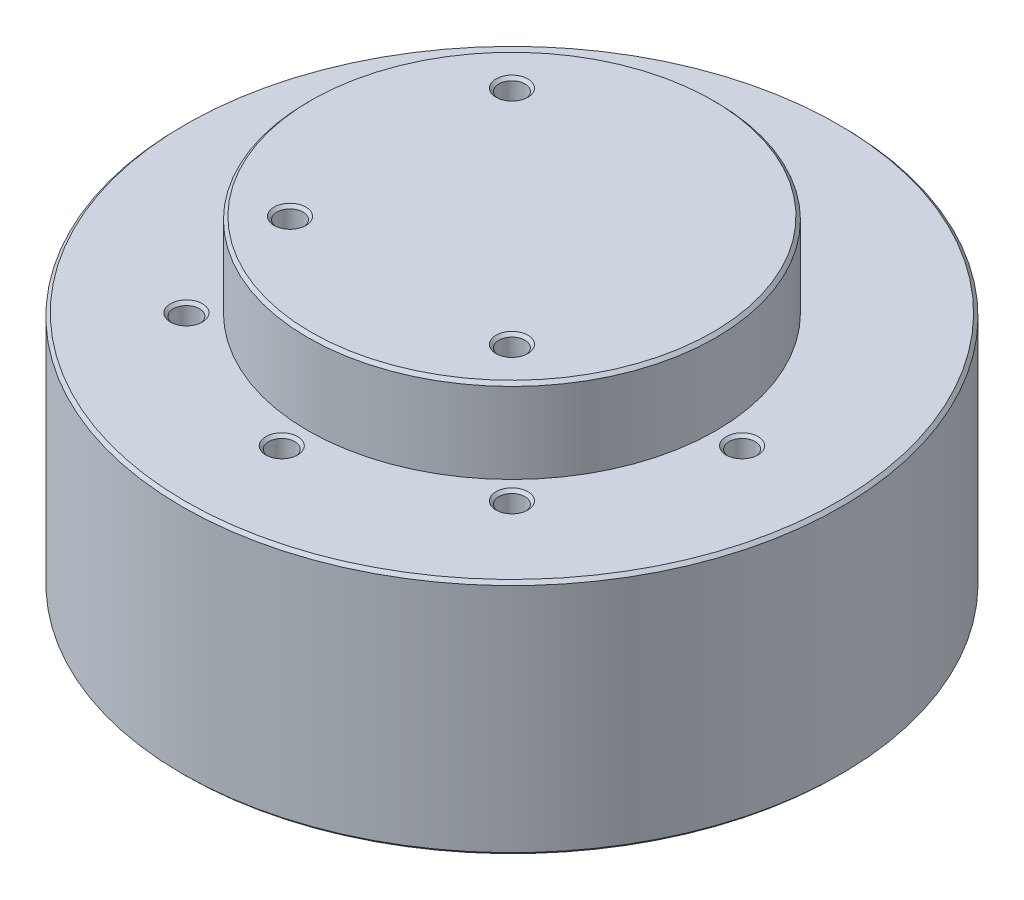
ISO-10303-21;
HEADER;
FILE_DESCRIPTION(('STEP AP214'),'2;1');
FILE_NAME('part.step','',(''),(''),'','','');
FILE_SCHEMA(('AUTOMOTIVE_DESIGN { 1 0 10303 214 1 1 1 1 }'));
ENDSEC;
DATA;
#1=APPLICATION_CONTEXT('core data for automotive mechanical design processes');
#2=APPLICATION_PROTOCOL_DEFINITION('international standard','automotive_design',2000,#1);
#3=PRODUCT_CONTEXT('',#1,'mechanical');
#4=PRODUCT('Part','Part','',(#3));
#5=PRODUCT_RELATED_PRODUCT_CATEGORY('part','',(#4));
#6=PRODUCT_DEFINITION_FORMATION('','',#4);
#7=PRODUCT_DEFINITION_CONTEXT('part definition',#1,'design');
#8=PRODUCT_DEFINITION('design','',#6,#7);
#9=PRODUCT_DEFINITION_SHAPE('','',#8);
#10=(LENGTH_UNIT() NAMED_UNIT(*) SI_UNIT(.MILLI.,.METRE.));
#11=(NAMED_UNIT(*) PLANE_ANGLE_UNIT() SI_UNIT($,.RADIAN.));
#12=(NAMED_UNIT(*) SI_UNIT($,.STERADIAN.) SOLID_ANGLE_UNIT());
#13=UNCERTAINTY_MEASURE_WITH_UNIT(LENGTH_MEASURE(1.E-05),#10,'distance_accuracy_value','');
#14=(GEOMETRIC_REPRESENTATION_CONTEXT(3) GLOBAL_UNCERTAINTY_ASSIGNED_CONTEXT((#13)) GLOBAL_UNIT_ASSIGNED_CONTEXT((#10,
#11,#12)) REPRESENTATION_CONTEXT('',''));
#15=CARTESIAN_POINT('',(0.,0.,0.));
#16=DIRECTION('',(0.,0.,1.));
#17=DIRECTION('',(1.,0.,0.));
#18=AXIS2_PLACEMENT_3D('',#15,#16,#17);
#19=CARTESIAN_POINT('',(0.,22.7,0.));
#20=DIRECTION('',(0.,-1.,0.));
#21=DIRECTION('',(0.,0.,-1.));
#22=AXIS2_PLACEMENT_3D('',#19,#20,#21);
#23=CYLINDRICAL_SURFACE('',#22,31.5);
#24=CARTESIAN_POINT('',(0.,0.300000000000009,0.));
#25=DIRECTION('',(0.,1.,0.));
#26=DIRECTION('',(0.,0.,1.));
#27=AXIS2_PLACEMENT_3D('',#24,#25,#26);
#28=CIRCLE('',#27,31.5);
#29=CARTESIAN_POINT('',(0.,0.300000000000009,31.5));
#30=VERTEX_POINT('',#29);
#31=EDGE_CURVE('E333',#30,#30,#28,.T.);
#32=ORIENTED_EDGE('',*,*,#31,.T.);
#33=EDGE_LOOP('',(#32));
#34=FACE_BOUND('',#33,.T.);
#35=CARTESIAN_POINT('',(0.,22.4,0.));
#36=DIRECTION('',(0.,1.,0.));
#37=DIRECTION('',(0.,0.,1.));
#38=AXIS2_PLACEMENT_3D('',#35,#36,#37);
#39=CIRCLE('',#38,31.5);
#40=CARTESIAN_POINT('',(0.,22.4,31.5));
#41=VERTEX_POINT('',#40);
#42=EDGE_CURVE('E330',#41,#41,#39,.F.);
#43=ORIENTED_EDGE('',*,*,#42,.T.);
#44=EDGE_LOOP('',(#43));
#45=FACE_BOUND('',#44,.T.);
#46=ADVANCED_FACE('F45',(#34,#45),#23,.T.);
#47=CARTESIAN_POINT('',(0.,22.7,0.));
#48=DIRECTION('',(0.,1.,0.));
#49=DIRECTION('',(0.,0.,1.));
#50=AXIS2_PLACEMENT_3D('',#47,#48,#49);
#51=PLANE('',#50);
#52=CARTESIAN_POINT('',(0.,22.7,0.));
#53=DIRECTION('',(0.,1.,0.));
#54=DIRECTION('',(0.,0.,1.));
#55=AXIS2_PLACEMENT_3D('',#52,#53,#54);
#56=CIRCLE('',#55,31.2);
#57=CARTESIAN_POINT('',(0.,22.7,31.2));
#58=VERTEX_POINT('',#57);
#59=EDGE_CURVE('E339',#58,#58,#56,.T.);
#60=ORIENTED_EDGE('',*,*,#59,.T.);
#61=EDGE_LOOP('',(#60));
#62=FACE_BOUND('',#61,.T.);
#63=CARTESIAN_POINT('',(-22.,22.7,0.));
#64=DIRECTION('',(0.,1.,0.));
#65=DIRECTION('',(0.,0.,1.));
#66=AXIS2_PLACEMENT_3D('',#63,#64,#65);
#67=CIRCLE('',#66,1.525);
#68=CARTESIAN_POINT('',(-22.,22.7,1.525));
#69=VERTEX_POINT('',#68);
#70=EDGE_CURVE('E138',#69,#69,#67,.T.);
#71=ORIENTED_EDGE('',*,*,#70,.F.);
#72=EDGE_LOOP('',(#71));
#73=FACE_BOUND('',#72,.T.);
#74=CARTESIAN_POINT('',(22.,22.7,0.));
#75=DIRECTION('',(0.,1.,0.));
#76=DIRECTION('',(0.,0.,1.));
#77=AXIS2_PLACEMENT_3D('',#74,#75,#76);
#78=CIRCLE('',#77,1.525);
#79=CARTESIAN_POINT('',(22.,22.7,1.525));
#80=VERTEX_POINT('',#79);
#81=EDGE_CURVE('E131',#80,#80,#78,.T.);
#82=ORIENTED_EDGE('',*,*,#81,.F.);
#83=EDGE_LOOP('',(#82));
#84=FACE_BOUND('',#83,.T.);
#85=CARTESIAN_POINT('',(0.,22.7,22.));
#86=DIRECTION('',(0.,1.,0.));
#87=DIRECTION('',(0.,0.,1.));
#88=AXIS2_PLACEMENT_3D('',#85,#86,#87);
#89=CIRCLE('',#88,1.525);
#90=CARTESIAN_POINT('',(0.,22.7,23.525));
#91=VERTEX_POINT('',#90);
#92=EDGE_CURVE('E147',#91,#91,#89,.T.);
#93=ORIENTED_EDGE('',*,*,#92,.F.);
#94=EDGE_LOOP('',(#93));
#95=FACE_BOUND('',#94,.T.);
#96=CARTESIAN_POINT('',(0.,22.7,-22.));
#97=DIRECTION('',(0.,1.,0.));
#98=DIRECTION('',(0.,0.,1.));
#99=AXIS2_PLACEMENT_3D('',#96,#97,#98);
#100=CIRCLE('',#99,1.525);
#101=CARTESIAN_POINT('',(0.,22.7,-20.475));
#102=VERTEX_POINT('',#101);
#103=EDGE_CURVE('E156',#102,#102,#100,.T.);
#104=ORIENTED_EDGE('',*,*,#103,.F.);
#105=EDGE_LOOP('',(#104));
#106=FACE_BOUND('',#105,.T.);
#107=CARTESIAN_POINT('',(-15.556349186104,22.7,-15.5563491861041));
#108=DIRECTION('',(0.,1.,0.));
#109=DIRECTION('',(0.,0.,1.));
#110=AXIS2_PLACEMENT_3D('',#107,#108,#109);
#111=CIRCLE('',#110,1.525);
#112=CARTESIAN_POINT('',(-15.556349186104,22.7,-14.0313491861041));
#113=VERTEX_POINT('',#112);
#114=EDGE_CURVE('E165',#113,#113,#111,.T.);
#115=ORIENTED_EDGE('',*,*,#114,.F.);
#116=EDGE_LOOP('',(#115));
#117=FACE_BOUND('',#116,.T.);
#118=CARTESIAN_POINT('',(-15.556349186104,22.7,15.5563491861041));
#119=DIRECTION('',(0.,1.,0.));
#120=DIRECTION('',(0.,0.,1.));
#121=AXIS2_PLACEMENT_3D('',#118,#119,#120);
#122=CIRCLE('',#121,1.525);
#123=CARTESIAN_POINT('',(-15.556349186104,22.7,17.0813491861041));
#124=VERTEX_POINT('',#123);
#125=EDGE_CURVE('E174',#124,#124,#122,.T.);
#126=ORIENTED_EDGE('',*,*,#125,.F.);
#127=EDGE_LOOP('',(#126));
#128=FACE_BOUND('',#127,.T.);
#129=CARTESIAN_POINT('',(15.556349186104,22.7,15.5563491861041));
#130=DIRECTION('',(0.,1.,0.));
#131=DIRECTION('',(0.,0.,1.));
#132=AXIS2_PLACEMENT_3D('',#129,#130,#131);
#133=CIRCLE('',#132,1.525);
#134=CARTESIAN_POINT('',(15.556349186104,22.7,17.0813491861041));
#135=VERTEX_POINT('',#134);
#136=EDGE_CURVE('E183',#135,#135,#133,.T.);
#137=ORIENTED_EDGE('',*,*,#136,.F.);
#138=EDGE_LOOP('',(#137));
#139=FACE_BOUND('',#138,.T.);
#140=CARTESIAN_POINT('',(0.,22.7,0.));
#141=DIRECTION('',(0.,1.,0.));
#142=DIRECTION('',(0.,0.,1.));
#143=AXIS2_PLACEMENT_3D('',#140,#141,#142);
#144=CIRCLE('',#143,19.5);
#145=CARTESIAN_POINT('',(0.,22.7,19.5));
#146=VERTEX_POINT('',#145);
#147=EDGE_CURVE('E327',#146,#146,#144,.T.);
#148=ORIENTED_EDGE('',*,*,#147,.F.);
#149=EDGE_LOOP('',(#148));
#150=FACE_BOUND('',#149,.T.);
#151=ADVANCED_FACE('F362',(#62,#73,#84,#95,#106,#117,#128,#139,#150),#51,.T.);
#152=CARTESIAN_POINT('',(0.,0.,0.));
#153=DIRECTION('',(0.,1.,0.));
#154=DIRECTION('',(0.,0.,1.));
#155=AXIS2_PLACEMENT_3D('',#152,#153,#154);
#156=PLANE('',#155);
#157=CARTESIAN_POINT('',(0.,0.,0.));
#158=DIRECTION('',(0.,-1.,0.));
#159=DIRECTION('',(0.,0.,-1.));
#160=AXIS2_PLACEMENT_3D('',#157,#158,#159);
#161=CIRCLE('',#160,6.3);
#162=CARTESIAN_POINT('',(0.,0.,-6.3));
#163=VERTEX_POINT('',#162);
#164=EDGE_CURVE('E1302',#163,#163,#161,.T.);
#165=ORIENTED_EDGE('',*,*,#164,.F.);
#166=EDGE_LOOP('',(#165));
#167=FACE_BOUND('',#166,.T.);
#168=CARTESIAN_POINT('',(0.,0.,0.));
#169=DIRECTION('',(0.,1.,0.));
#170=DIRECTION('',(0.,0.,1.));
#171=AXIS2_PLACEMENT_3D('',#168,#169,#170);
#172=CIRCLE('',#171,31.2);
#173=CARTESIAN_POINT('',(0.,0.,31.2));
#174=VERTEX_POINT('',#173);
#175=EDGE_CURVE('E336',#174,#174,#172,.F.);
#176=ORIENTED_EDGE('',*,*,#175,.T.);
#177=EDGE_LOOP('',(#176));
#178=FACE_BOUND('',#177,.T.);
#179=CARTESIAN_POINT('',(14.,0.,-17.));
#180=DIRECTION('',(0.,-1.,0.));
#181=DIRECTION('',(0.,0.,-1.));
#182=AXIS2_PLACEMENT_3D('',#179,#180,#181);
#183=CIRCLE('',#182,1.525);
#184=CARTESIAN_POINT('',(14.,0.,-18.525));
#185=VERTEX_POINT('',#184);
#186=EDGE_CURVE('E219',#185,#185,#183,.T.);
#187=ORIENTED_EDGE('',*,*,#186,.F.);
#188=EDGE_LOOP('',(#187));
#189=FACE_BOUND('',#188,.T.);
#190=CARTESIAN_POINT('',(-14.,0.,17.));
#191=DIRECTION('',(0.,-1.,0.));
#192=DIRECTION('',(0.,0.,-1.));
#193=AXIS2_PLACEMENT_3D('',#190,#191,#192);
#194=CIRCLE('',#193,1.525);
#195=CARTESIAN_POINT('',(-14.,0.,15.475));
#196=VERTEX_POINT('',#195);
#197=EDGE_CURVE('E228',#196,#196,#194,.T.);
#198=ORIENTED_EDGE('',*,*,#197,.F.);
#199=EDGE_LOOP('',(#198));
#200=FACE_BOUND('',#199,.T.);
#201=CARTESIAN_POINT('',(-14.,0.,-17.));
#202=DIRECTION('',(0.,-1.,0.));
#203=DIRECTION('',(0.,0.,-1.));
#204=AXIS2_PLACEMENT_3D('',#201,#202,#203);
#205=CIRCLE('',#204,1.525);
#206=CARTESIAN_POINT('',(-14.,0.,-18.525));
#207=VERTEX_POINT('',#206);
#208=EDGE_CURVE('E237',#207,#207,#205,.T.);
#209=ORIENTED_EDGE('',*,*,#208,.F.);
#210=EDGE_LOOP('',(#209));
#211=FACE_BOUND('',#210,.T.);
#212=CARTESIAN_POINT('',(14.,0.,17.));
#213=DIRECTION('',(0.,-1.,0.));
#214=DIRECTION('',(0.,0.,-1.));
#215=AXIS2_PLACEMENT_3D('',#212,#213,#214);
#216=CIRCLE('',#215,1.525);
#217=CARTESIAN_POINT('',(14.,0.,15.475));
#218=VERTEX_POINT('',#217);
#219=EDGE_CURVE('E246',#218,#218,#216,.T.);
#220=ORIENTED_EDGE('',*,*,#219,.F.);
#221=EDGE_LOOP('',(#220));
#222=FACE_BOUND('',#221,.T.);
#223=CARTESIAN_POINT('',(10.6066017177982,0.,-10.6066017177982));
#224=DIRECTION('',(0.,-1.,0.));
#225=DIRECTION('',(0.,0.,-1.));
#226=AXIS2_PLACEMENT_3D('',#223,#224,#225);
#227=CIRCLE('',#226,1.525);
#228=CARTESIAN_POINT('',(10.6066017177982,0.,-12.1316017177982));
#229=VERTEX_POINT('',#228);
#230=EDGE_CURVE('E255',#229,#229,#227,.T.);
#231=ORIENTED_EDGE('',*,*,#230,.F.);
#232=EDGE_LOOP('',(#231));
#233=FACE_BOUND('',#232,.T.);
#234=CARTESIAN_POINT('',(-10.6066017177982,0.,-10.6066017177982));
#235=DIRECTION('',(0.,-1.,0.));
#236=DIRECTION('',(0.,0.,-1.));
#237=AXIS2_PLACEMENT_3D('',#234,#235,#236);
#238=CIRCLE('',#237,1.525);
#239=CARTESIAN_POINT('',(-10.6066017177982,0.,-12.1316017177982));
#240=VERTEX_POINT('',#239);
#241=EDGE_CURVE('E264',#240,#240,#238,.T.);
#242=ORIENTED_EDGE('',*,*,#241,.F.);
#243=EDGE_LOOP('',(#242));
#244=FACE_BOUND('',#243,.T.);
#245=CARTESIAN_POINT('',(10.6066017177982,0.,10.6066017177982));
#246=DIRECTION('',(0.,-1.,0.));
#247=DIRECTION('',(0.,0.,-1.));
#248=AXIS2_PLACEMENT_3D('',#245,#246,#247);
#249=CIRCLE('',#248,1.525);
#250=CARTESIAN_POINT('',(10.6066017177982,0.,9.08160171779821));
#251=VERTEX_POINT('',#250);
#252=EDGE_CURVE('E273',#251,#251,#249,.T.);
#253=ORIENTED_EDGE('',*,*,#252,.F.);
#254=EDGE_LOOP('',(#253));
#255=FACE_BOUND('',#254,.T.);
#256=CARTESIAN_POINT('',(-10.6066017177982,0.,10.6066017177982));
#257=DIRECTION('',(0.,-1.,0.));
#258=DIRECTION('',(0.,0.,-1.));
#259=AXIS2_PLACEMENT_3D('',#256,#257,#258);
#260=CIRCLE('',#259,1.525);
#261=CARTESIAN_POINT('',(-10.6066017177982,0.,9.08160171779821));
#262=VERTEX_POINT('',#261);
#263=EDGE_CURVE('E282',#262,#262,#260,.T.);
#264=ORIENTED_EDGE('',*,*,#263,.F.);
#265=EDGE_LOOP('',(#264));
#266=FACE_BOUND('',#265,.T.);
#267=CARTESIAN_POINT('',(0.,0.,-12.5));
#268=DIRECTION('',(0.,-1.,0.));
#269=DIRECTION('',(0.,0.,-1.));
#270=AXIS2_PLACEMENT_3D('',#267,#268,#269);
#271=CIRCLE('',#270,1.525);
#272=CARTESIAN_POINT('',(0.,0.,-14.025));
#273=VERTEX_POINT('',#272);
#274=EDGE_CURVE('E291',#273,#273,#271,.T.);
#275=ORIENTED_EDGE('',*,*,#274,.F.);
#276=EDGE_LOOP('',(#275));
#277=FACE_BOUND('',#276,.T.);
#278=CARTESIAN_POINT('',(12.5,0.,0.));
#279=DIRECTION('',(0.,-1.,0.));
#280=DIRECTION('',(0.,0.,-1.));
#281=AXIS2_PLACEMENT_3D('',#278,#279,#280);
#282=CIRCLE('',#281,1.525);
#283=CARTESIAN_POINT('',(12.5,0.,-1.525));
#284=VERTEX_POINT('',#283);
#285=EDGE_CURVE('E300',#284,#284,#282,.T.);
#286=ORIENTED_EDGE('',*,*,#285,.F.);
#287=EDGE_LOOP('',(#286));
#288=FACE_BOUND('',#287,.T.);
#289=CARTESIAN_POINT('',(0.,0.,12.5));
#290=DIRECTION('',(0.,-1.,0.));
#291=DIRECTION('',(0.,0.,-1.));
#292=AXIS2_PLACEMENT_3D('',#289,#290,#291);
#293=CIRCLE('',#292,1.525);
#294=CARTESIAN_POINT('',(0.,0.,10.975));
#295=VERTEX_POINT('',#294);
#296=EDGE_CURVE('E309',#295,#295,#293,.T.);
#297=ORIENTED_EDGE('',*,*,#296,.F.);
#298=EDGE_LOOP('',(#297));
#299=FACE_BOUND('',#298,.T.);
#300=CARTESIAN_POINT('',(-12.5,0.,0.));
#301=DIRECTION('',(0.,-1.,0.));
#302=DIRECTION('',(0.,0.,-1.));
#303=AXIS2_PLACEMENT_3D('',#300,#301,#302);
#304=CIRCLE('',#303,1.525);
#305=CARTESIAN_POINT('',(-12.5,0.,-1.525));
#306=VERTEX_POINT('',#305);
#307=EDGE_CURVE('E318',#306,#306,#304,.T.);
#308=ORIENTED_EDGE('',*,*,#307,.F.);
#309=EDGE_LOOP('',(#308));
#310=FACE_BOUND('',#309,.T.);
#311=ADVANCED_FACE('F368',(#167,#178,#189,#200,#211,#222,#233,#244,#255,#266,#277,#288,#299,
#310),#156,.F.);
#312=CARTESIAN_POINT('',(0.,30.7,0.));
#313=DIRECTION('',(0.,-1.,0.));
#314=DIRECTION('',(0.,0.,-1.));
#315=AXIS2_PLACEMENT_3D('',#312,#313,#314);
#316=CYLINDRICAL_SURFACE('',#315,19.5);
#317=CARTESIAN_POINT('',(0.,30.4,0.));
#318=DIRECTION('',(0.,1.,0.));
#319=DIRECTION('',(0.,0.,1.));
#320=AXIS2_PLACEMENT_3D('',#317,#318,#319);
#321=CIRCLE('',#320,19.5);
#322=CARTESIAN_POINT('',(0.,30.4,19.5));
#323=VERTEX_POINT('',#322);
#324=EDGE_CURVE('E11',#323,#323,#321,.F.);
#325=ORIENTED_EDGE('',*,*,#324,.T.);
#326=EDGE_LOOP('',(#325));
#327=FACE_BOUND('',#326,.T.);
#328=ORIENTED_EDGE('',*,*,#147,.T.);
#329=EDGE_LOOP('',(#328));
#330=FACE_BOUND('',#329,.T.);
#331=ADVANCED_FACE('F396',(#327,#330),#316,.T.);
#332=CARTESIAN_POINT('',(0.,30.7,0.));
#333=DIRECTION('',(0.,1.,0.));
#334=DIRECTION('',(0.,0.,1.));
#335=AXIS2_PLACEMENT_3D('',#332,#333,#334);
#336=PLANE('',#335);
#337=CARTESIAN_POINT('',(0.,30.7,0.));
#338=DIRECTION('',(0.,1.,0.));
#339=DIRECTION('',(0.,0.,1.));
#340=AXIS2_PLACEMENT_3D('',#337,#338,#339);
#341=CIRCLE('',#340,19.2);
#342=CARTESIAN_POINT('',(0.,30.7,19.2));
#343=VERTEX_POINT('',#342);
#344=EDGE_CURVE('E54',#343,#343,#341,.T.);
#345=ORIENTED_EDGE('',*,*,#344,.T.);
#346=EDGE_LOOP('',(#345));
#347=FACE_BOUND('',#346,.T.);
#348=CARTESIAN_POINT('',(-10.6066017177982,30.7,-10.6066017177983));
#349=DIRECTION('',(0.,1.,0.));
#350=DIRECTION('',(0.,0.,1.));
#351=AXIS2_PLACEMENT_3D('',#348,#349,#350);
#352=CIRCLE('',#351,1.525);
#353=CARTESIAN_POINT('',(-10.6066017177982,30.7,-9.08160171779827));
#354=VERTEX_POINT('',#353);
#355=EDGE_CURVE('E192',#354,#354,#352,.T.);
#356=ORIENTED_EDGE('',*,*,#355,.F.);
#357=EDGE_LOOP('',(#356));
#358=FACE_BOUND('',#357,.T.);
#359=CARTESIAN_POINT('',(-10.6066017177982,30.7,10.6066017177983));
#360=DIRECTION('',(0.,1.,0.));
#361=DIRECTION('',(0.,0.,1.));
#362=AXIS2_PLACEMENT_3D('',#359,#360,#361);
#363=CIRCLE('',#362,1.525);
#364=CARTESIAN_POINT('',(-10.6066017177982,30.7,12.1316017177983));
#365=VERTEX_POINT('',#364);
#366=EDGE_CURVE('E201',#365,#365,#363,.T.);
#367=ORIENTED_EDGE('',*,*,#366,.F.);
#368=EDGE_LOOP('',(#367));
#369=FACE_BOUND('',#368,.T.);
#370=CARTESIAN_POINT('',(10.6066017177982,30.7,10.6066017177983));
#371=DIRECTION('',(0.,1.,0.));
#372=DIRECTION('',(0.,0.,1.));
#373=AXIS2_PLACEMENT_3D('',#370,#371,#372);
#374=CIRCLE('',#373,1.525);
#375=CARTESIAN_POINT('',(10.6066017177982,30.7,12.1316017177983));
#376=VERTEX_POINT('',#375);
#377=EDGE_CURVE('E210',#376,#376,#374,.T.);
#378=ORIENTED_EDGE('',*,*,#377,.F.);
#379=EDGE_LOOP('',(#378));
#380=FACE_BOUND('',#379,.T.);
#381=ADVANCED_FACE('F344',(#347,#358,#369,#380),#336,.T.);
#382=CARTESIAN_POINT('',(-12.5,7.49999999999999,0.));
#383=DIRECTION('',(0.,-1.,0.));
#384=DIRECTION('',(0.,0.,-1.));
#385=AXIS2_PLACEMENT_3D('',#382,#383,#384);
#386=CONICAL_SURFACE('',#385,1.24999999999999,1.02974425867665);
#387=CARTESIAN_POINT('',(-12.5,8.25107577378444,0.));
#388=VERTEX_POINT('',#387);
#389=VERTEX_LOOP('',#388);
#390=FACE_BOUND('',#389,.T.);
#391=CARTESIAN_POINT('',(-12.5,7.49999999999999,0.));
#392=DIRECTION('',(0.,-1.,0.));
#393=DIRECTION('',(0.,0.,-1.));
#394=AXIS2_PLACEMENT_3D('',#391,#392,#393);
#395=CIRCLE('',#394,1.24999999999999);
#396=CARTESIAN_POINT('',(-12.5,7.49999999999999,-1.24999999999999));
#397=VERTEX_POINT('',#396);
#398=EDGE_CURVE('E324',#397,#397,#395,.T.);
#399=ORIENTED_EDGE('',*,*,#398,.T.);
#400=EDGE_LOOP('',(#399));
#401=FACE_BOUND('',#400,.T.);
#402=ADVANCED_FACE('F434',(#390,#401),#386,.F.);
#403=CARTESIAN_POINT('',(-12.5,0.,0.));
#404=DIRECTION('',(0.,-1.,0.));
#405=DIRECTION('',(0.,0.,-1.));
#406=AXIS2_PLACEMENT_3D('',#403,#404,#405);
#407=CYLINDRICAL_SURFACE('',#406,1.24999999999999);
#408=ORIENTED_EDGE('',*,*,#398,.F.);
#409=EDGE_LOOP('',(#408));
#410=FACE_BOUND('',#409,.T.);
#411=CARTESIAN_POINT('',(-12.5,0.275000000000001,0.));
#412=DIRECTION('',(0.,-1.,0.));
#413=DIRECTION('',(0.,0.,-1.));
#414=AXIS2_PLACEMENT_3D('',#411,#412,#413);
#415=CIRCLE('',#414,1.25);
#416=CARTESIAN_POINT('',(-12.5,0.275000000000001,-1.25));
#417=VERTEX_POINT('',#416);
#418=EDGE_CURVE('E321',#417,#417,#415,.T.);
#419=ORIENTED_EDGE('',*,*,#418,.T.);
#420=EDGE_LOOP('',(#419));
#421=FACE_BOUND('',#420,.T.);
#422=ADVANCED_FACE('F425',(#410,#421),#407,.F.);
#423=CARTESIAN_POINT('',(-12.5,0.,0.));
#424=DIRECTION('',(0.,-1.,0.));
#425=DIRECTION('',(0.,0.,-1.));
#426=AXIS2_PLACEMENT_3D('',#423,#424,#425);
#427=CONICAL_SURFACE('',#426,1.525,0.785398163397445);
#428=ORIENTED_EDGE('',*,*,#418,.F.);
#429=EDGE_LOOP('',(#428));
#430=FACE_BOUND('',#429,.T.);
#431=ORIENTED_EDGE('',*,*,#307,.T.);
#432=EDGE_LOOP('',(#431));
#433=FACE_BOUND('',#432,.T.);
#434=ADVANCED_FACE('F422',(#430,#433),#427,.F.);
#435=CARTESIAN_POINT('',(0.,7.49999999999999,12.5));
#436=DIRECTION('',(0.,-1.,0.));
#437=DIRECTION('',(0.,0.,-1.));
#438=AXIS2_PLACEMENT_3D('',#435,#436,#437);
#439=CONICAL_SURFACE('',#438,1.24999999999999,1.02974425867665);
#440=CARTESIAN_POINT('',(0.,8.25107577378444,12.5));
#441=VERTEX_POINT('',#440);
#442=VERTEX_LOOP('',#441);
#443=FACE_BOUND('',#442,.T.);
#444=CARTESIAN_POINT('',(0.,7.49999999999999,12.5));
#445=DIRECTION('',(0.,-1.,0.));
#446=DIRECTION('',(0.,0.,-1.));
#447=AXIS2_PLACEMENT_3D('',#444,#445,#446);
#448=CIRCLE('',#447,1.24999999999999);
#449=CARTESIAN_POINT('',(0.,7.49999999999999,11.25));
#450=VERTEX_POINT('',#449);
#451=EDGE_CURVE('E315',#450,#450,#448,.T.);
#452=ORIENTED_EDGE('',*,*,#451,.T.);
#453=EDGE_LOOP('',(#452));
#454=FACE_BOUND('',#453,.T.);
#455=ADVANCED_FACE('F424',(#443,#454),#439,.F.);
#456=CARTESIAN_POINT('',(0.,0.,12.5));
#457=DIRECTION('',(0.,-1.,0.));
#458=DIRECTION('',(0.,0.,-1.));
#459=AXIS2_PLACEMENT_3D('',#456,#457,#458);
#460=CYLINDRICAL_SURFACE('',#459,1.24999999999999);
#461=ORIENTED_EDGE('',*,*,#451,.F.);
#462=EDGE_LOOP('',(#461));
#463=FACE_BOUND('',#462,.T.);
#464=CARTESIAN_POINT('',(0.,0.275000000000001,12.5));
#465=DIRECTION('',(0.,-1.,0.));
#466=DIRECTION('',(0.,0.,-1.));
#467=AXIS2_PLACEMENT_3D('',#464,#465,#466);
#468=CIRCLE('',#467,1.25);
#469=CARTESIAN_POINT('',(0.,0.275000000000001,11.25));
#470=VERTEX_POINT('',#469);
#471=EDGE_CURVE('E312',#470,#470,#468,.T.);
#472=ORIENTED_EDGE('',*,*,#471,.T.);
#473=EDGE_LOOP('',(#472));
#474=FACE_BOUND('',#473,.T.);
#475=ADVANCED_FACE('F432',(#463,#474),#460,.F.);
#476=CARTESIAN_POINT('',(0.,0.,12.5));
#477=DIRECTION('',(0.,-1.,0.));
#478=DIRECTION('',(0.,0.,-1.));
#479=AXIS2_PLACEMENT_3D('',#476,#477,#478);
#480=CONICAL_SURFACE('',#479,1.525,0.785398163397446);
#481=ORIENTED_EDGE('',*,*,#471,.F.);
#482=EDGE_LOOP('',(#481));
#483=FACE_BOUND('',#482,.T.);
#484=ORIENTED_EDGE('',*,*,#296,.T.);
#485=EDGE_LOOP('',(#484));
#486=FACE_BOUND('',#485,.T.);
#487=ADVANCED_FACE('F481',(#483,#486),#480,.F.);
#488=CARTESIAN_POINT('',(12.5,7.49999999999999,0.));
#489=DIRECTION('',(0.,-1.,0.));
#490=DIRECTION('',(0.,0.,-1.));
#491=AXIS2_PLACEMENT_3D('',#488,#489,#490);
#492=CONICAL_SURFACE('',#491,1.24999999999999,1.02974425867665);
#493=CARTESIAN_POINT('',(12.5,8.25107577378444,0.));
#494=VERTEX_POINT('',#493);
#495=VERTEX_LOOP('',#494);
#496=FACE_BOUND('',#495,.T.);
#497=CARTESIAN_POINT('',(12.5,7.49999999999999,0.));
#498=DIRECTION('',(0.,-1.,0.));
#499=DIRECTION('',(0.,0.,-1.));
#500=AXIS2_PLACEMENT_3D('',#497,#498,#499);
#501=CIRCLE('',#500,1.24999999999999);
#502=CARTESIAN_POINT('',(12.5,7.49999999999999,-1.24999999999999));
#503=VERTEX_POINT('',#502);
#504=EDGE_CURVE('E306',#503,#503,#501,.T.);
#505=ORIENTED_EDGE('',*,*,#504,.T.);
#506=EDGE_LOOP('',(#505));
#507=FACE_BOUND('',#506,.T.);
#508=ADVANCED_FACE('F493',(#496,#507),#492,.F.);
#509=CARTESIAN_POINT('',(12.5,0.,0.));
#510=DIRECTION('',(0.,-1.,0.));
#511=DIRECTION('',(0.,0.,-1.));
#512=AXIS2_PLACEMENT_3D('',#509,#510,#511);
#513=CYLINDRICAL_SURFACE('',#512,1.24999999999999);
#514=ORIENTED_EDGE('',*,*,#504,.F.);
#515=EDGE_LOOP('',(#514));
#516=FACE_BOUND('',#515,.T.);
#517=CARTESIAN_POINT('',(12.5,0.275000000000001,0.));
#518=DIRECTION('',(0.,-1.,0.));
#519=DIRECTION('',(0.,0.,-1.));
#520=AXIS2_PLACEMENT_3D('',#517,#518,#519);
#521=CIRCLE('',#520,1.25);
#522=CARTESIAN_POINT('',(12.5,0.275000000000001,-1.25));
#523=VERTEX_POINT('',#522);
#524=EDGE_CURVE('E303',#523,#523,#521,.T.);
#525=ORIENTED_EDGE('',*,*,#524,.T.);
#526=EDGE_LOOP('',(#525));
#527=FACE_BOUND('',#526,.T.);
#528=ADVANCED_FACE('F488',(#516,#527),#513,.F.);
#529=CARTESIAN_POINT('',(12.5,0.,0.));
#530=DIRECTION('',(0.,-1.,0.));
#531=DIRECTION('',(0.,0.,-1.));
#532=AXIS2_PLACEMENT_3D('',#529,#530,#531);
#533=CONICAL_SURFACE('',#532,1.525,0.785398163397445);
#534=ORIENTED_EDGE('',*,*,#524,.F.);
#535=EDGE_LOOP('',(#534));
#536=FACE_BOUND('',#535,.T.);
#537=ORIENTED_EDGE('',*,*,#285,.T.);
#538=EDGE_LOOP('',(#537));
#539=FACE_BOUND('',#538,.T.);
#540=ADVANCED_FACE('F492',(#536,#539),#533,.F.);
#541=CARTESIAN_POINT('',(0.,7.49999999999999,-12.5));
#542=DIRECTION('',(0.,-1.,0.));
#543=DIRECTION('',(0.,0.,-1.));
#544=AXIS2_PLACEMENT_3D('',#541,#542,#543);
#545=CONICAL_SURFACE('',#544,1.24999999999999,1.02974425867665);
#546=CARTESIAN_POINT('',(0.,8.25107577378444,-12.5));
#547=VERTEX_POINT('',#546);
#548=VERTEX_LOOP('',#547);
#549=FACE_BOUND('',#548,.T.);
#550=CARTESIAN_POINT('',(0.,7.49999999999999,-12.5));
#551=DIRECTION('',(0.,-1.,0.));
#552=DIRECTION('',(0.,0.,-1.));
#553=AXIS2_PLACEMENT_3D('',#550,#551,#552);
#554=CIRCLE('',#553,1.24999999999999);
#555=CARTESIAN_POINT('',(0.,7.49999999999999,-13.75));
#556=VERTEX_POINT('',#555);
#557=EDGE_CURVE('E297',#556,#556,#554,.T.);
#558=ORIENTED_EDGE('',*,*,#557,.T.);
#559=EDGE_LOOP('',(#558));
#560=FACE_BOUND('',#559,.T.);
#561=ADVANCED_FACE('F507',(#549,#560),#545,.F.);
#562=CARTESIAN_POINT('',(0.,0.,-12.5));
#563=DIRECTION('',(0.,-1.,0.));
#564=DIRECTION('',(0.,0.,-1.));
#565=AXIS2_PLACEMENT_3D('',#562,#563,#564);
#566=CYLINDRICAL_SURFACE('',#565,1.24999999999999);
#567=ORIENTED_EDGE('',*,*,#557,.F.);
#568=EDGE_LOOP('',(#567));
#569=FACE_BOUND('',#568,.T.);
#570=CARTESIAN_POINT('',(0.,0.275000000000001,-12.5));
#571=DIRECTION('',(0.,-1.,0.));
#572=DIRECTION('',(0.,0.,-1.));
#573=AXIS2_PLACEMENT_3D('',#570,#571,#572);
#574=CIRCLE('',#573,1.25);
#575=CARTESIAN_POINT('',(0.,0.275000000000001,-13.75));
#576=VERTEX_POINT('',#575);
#577=EDGE_CURVE('E294',#576,#576,#574,.T.);
#578=ORIENTED_EDGE('',*,*,#577,.T.);
#579=EDGE_LOOP('',(#578));
#580=FACE_BOUND('',#579,.T.);
#581=ADVANCED_FACE('F502',(#569,#580),#566,.F.);
#582=CARTESIAN_POINT('',(0.,0.,-12.5));
#583=DIRECTION('',(0.,-1.,0.));
#584=DIRECTION('',(0.,0.,-1.));
#585=AXIS2_PLACEMENT_3D('',#582,#583,#584);
#586=CONICAL_SURFACE('',#585,1.525,0.785398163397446);
#587=ORIENTED_EDGE('',*,*,#577,.F.);
#588=EDGE_LOOP('',(#587));
#589=FACE_BOUND('',#588,.T.);
#590=ORIENTED_EDGE('',*,*,#274,.T.);
#591=EDGE_LOOP('',(#590));
#592=FACE_BOUND('',#591,.T.);
#593=ADVANCED_FACE('F506',(#589,#592),#586,.F.);
#594=CARTESIAN_POINT('',(-10.6066017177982,7.49999999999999,10.6066017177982));
#595=DIRECTION('',(0.,-1.,0.));
#596=DIRECTION('',(0.,0.,-1.));
#597=AXIS2_PLACEMENT_3D('',#594,#595,#596);
#598=CONICAL_SURFACE('',#597,1.24999999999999,1.02974425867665);
#599=CARTESIAN_POINT('',(-10.6066017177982,8.25107577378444,10.6066017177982));
#600=VERTEX_POINT('',#599);
#601=VERTEX_LOOP('',#600);
#602=FACE_BOUND('',#601,.T.);
#603=CARTESIAN_POINT('',(-10.6066017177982,7.49999999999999,10.6066017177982));
#604=DIRECTION('',(0.,-1.,0.));
#605=DIRECTION('',(0.,0.,-1.));
#606=AXIS2_PLACEMENT_3D('',#603,#604,#605);
#607=CIRCLE('',#606,1.24999999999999);
#608=CARTESIAN_POINT('',(-10.6066017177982,7.49999999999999,9.35660171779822));
#609=VERTEX_POINT('',#608);
#610=EDGE_CURVE('E288',#609,#609,#607,.T.);
#611=ORIENTED_EDGE('',*,*,#610,.T.);
#612=EDGE_LOOP('',(#611));
#613=FACE_BOUND('',#612,.T.);
#614=ADVANCED_FACE('F774',(#602,#613),#598,.F.);
#615=CARTESIAN_POINT('',(-10.6066017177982,0.,10.6066017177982));
#616=DIRECTION('',(0.,-1.,0.));
#617=DIRECTION('',(0.,0.,-1.));
#618=AXIS2_PLACEMENT_3D('',#615,#616,#617);
#619=CYLINDRICAL_SURFACE('',#618,1.24999999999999);
#620=ORIENTED_EDGE('',*,*,#610,.F.);
#621=EDGE_LOOP('',(#620));
#622=FACE_BOUND('',#621,.T.);
#623=CARTESIAN_POINT('',(-10.6066017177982,0.275000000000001,10.6066017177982));
#624=DIRECTION('',(0.,-1.,0.));
#625=DIRECTION('',(0.,0.,-1.));
#626=AXIS2_PLACEMENT_3D('',#623,#624,#625);
#627=CIRCLE('',#626,1.25);
#628=CARTESIAN_POINT('',(-10.6066017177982,0.275000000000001,9.35660171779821));
#629=VERTEX_POINT('',#628);
#630=EDGE_CURVE('E285',#629,#629,#627,.T.);
#631=ORIENTED_EDGE('',*,*,#630,.T.);
#632=EDGE_LOOP('',(#631));
#633=FACE_BOUND('',#632,.T.);
#634=ADVANCED_FACE('F785',(#622,#633),#619,.F.);
#635=CARTESIAN_POINT('',(-10.6066017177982,0.,10.6066017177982));
#636=DIRECTION('',(0.,-1.,0.));
#637=DIRECTION('',(0.,0.,-1.));
#638=AXIS2_PLACEMENT_3D('',#635,#636,#637);
#639=CONICAL_SURFACE('',#638,1.525,0.785398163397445);
#640=ORIENTED_EDGE('',*,*,#630,.F.);
#641=EDGE_LOOP('',(#640));
#642=FACE_BOUND('',#641,.T.);
#643=ORIENTED_EDGE('',*,*,#263,.T.);
#644=EDGE_LOOP('',(#643));
#645=FACE_BOUND('',#644,.T.);
#646=ADVANCED_FACE('F796',(#642,#645),#639,.F.);
#647=CARTESIAN_POINT('',(10.6066017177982,7.49999999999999,10.6066017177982));
#648=DIRECTION('',(0.,-1.,0.));
#649=DIRECTION('',(0.,0.,-1.));
#650=AXIS2_PLACEMENT_3D('',#647,#648,#649);
#651=CONICAL_SURFACE('',#650,1.24999999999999,1.02974425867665);
#652=CARTESIAN_POINT('',(10.6066017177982,8.25107577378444,10.6066017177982));
#653=VERTEX_POINT('',#652);
#654=VERTEX_LOOP('',#653);
#655=FACE_BOUND('',#654,.T.);
#656=CARTESIAN_POINT('',(10.6066017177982,7.49999999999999,10.6066017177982));
#657=DIRECTION('',(0.,-1.,0.));
#658=DIRECTION('',(0.,0.,-1.));
#659=AXIS2_PLACEMENT_3D('',#656,#657,#658);
#660=CIRCLE('',#659,1.24999999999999);
#661=CARTESIAN_POINT('',(10.6066017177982,7.49999999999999,9.35660171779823));
#662=VERTEX_POINT('',#661);
#663=EDGE_CURVE('E279',#662,#662,#660,.T.);
#664=ORIENTED_EDGE('',*,*,#663,.T.);
#665=EDGE_LOOP('',(#664));
#666=FACE_BOUND('',#665,.T.);
#667=ADVANCED_FACE('F808',(#655,#666),#651,.F.);
#668=CARTESIAN_POINT('',(10.6066017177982,0.,10.6066017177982));
#669=DIRECTION('',(0.,-1.,0.));
#670=DIRECTION('',(0.,0.,-1.));
#671=AXIS2_PLACEMENT_3D('',#668,#669,#670);
#672=CYLINDRICAL_SURFACE('',#671,1.24999999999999);
#673=ORIENTED_EDGE('',*,*,#663,.F.);
#674=EDGE_LOOP('',(#673));
#675=FACE_BOUND('',#674,.T.);
#676=CARTESIAN_POINT('',(10.6066017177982,0.275000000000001,10.6066017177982));
#677=DIRECTION('',(0.,-1.,0.));
#678=DIRECTION('',(0.,0.,-1.));
#679=AXIS2_PLACEMENT_3D('',#676,#677,#678);
#680=CIRCLE('',#679,1.25);
#681=CARTESIAN_POINT('',(10.6066017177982,0.275000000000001,9.35660171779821));
#682=VERTEX_POINT('',#681);
#683=EDGE_CURVE('E276',#682,#682,#680,.T.);
#684=ORIENTED_EDGE('',*,*,#683,.T.);
#685=EDGE_LOOP('',(#684));
#686=FACE_BOUND('',#685,.T.);
#687=ADVANCED_FACE('F819',(#675,#686),#672,.F.);
#688=CARTESIAN_POINT('',(10.6066017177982,0.,10.6066017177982));
#689=DIRECTION('',(0.,-1.,0.));
#690=DIRECTION('',(0.,0.,-1.));
#691=AXIS2_PLACEMENT_3D('',#688,#689,#690);
#692=CONICAL_SURFACE('',#691,1.525,0.785398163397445);
#693=ORIENTED_EDGE('',*,*,#683,.F.);
#694=EDGE_LOOP('',(#693));
#695=FACE_BOUND('',#694,.T.);
#696=ORIENTED_EDGE('',*,*,#252,.T.);
#697=EDGE_LOOP('',(#696));
#698=FACE_BOUND('',#697,.T.);
#699=ADVANCED_FACE('F830',(#695,#698),#692,.F.);
#700=CARTESIAN_POINT('',(-10.6066017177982,7.49999999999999,-10.6066017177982));
#701=DIRECTION('',(0.,-1.,0.));
#702=DIRECTION('',(0.,0.,-1.));
#703=AXIS2_PLACEMENT_3D('',#700,#701,#702);
#704=CONICAL_SURFACE('',#703,1.24999999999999,1.02974425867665);
#705=CARTESIAN_POINT('',(-10.6066017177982,8.25107577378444,-10.6066017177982));
#706=VERTEX_POINT('',#705);
#707=VERTEX_LOOP('',#706);
#708=FACE_BOUND('',#707,.T.);
#709=CARTESIAN_POINT('',(-10.6066017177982,7.49999999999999,-10.6066017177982));
#710=DIRECTION('',(0.,-1.,0.));
#711=DIRECTION('',(0.,0.,-1.));
#712=AXIS2_PLACEMENT_3D('',#709,#710,#711);
#713=CIRCLE('',#712,1.24999999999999);
#714=CARTESIAN_POINT('',(-10.6066017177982,7.49999999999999,-11.8566017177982));
#715=VERTEX_POINT('',#714);
#716=EDGE_CURVE('E270',#715,#715,#713,.T.);
#717=ORIENTED_EDGE('',*,*,#716,.T.);
#718=EDGE_LOOP('',(#717));
#719=FACE_BOUND('',#718,.T.);
#720=ADVANCED_FACE('F842',(#708,#719),#704,.F.);
#721=CARTESIAN_POINT('',(-10.6066017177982,0.,-10.6066017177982));
#722=DIRECTION('',(0.,-1.,0.));
#723=DIRECTION('',(0.,0.,-1.));
#724=AXIS2_PLACEMENT_3D('',#721,#722,#723);
#725=CYLINDRICAL_SURFACE('',#724,1.24999999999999);
#726=ORIENTED_EDGE('',*,*,#716,.F.);
#727=EDGE_LOOP('',(#726));
#728=FACE_BOUND('',#727,.T.);
#729=CARTESIAN_POINT('',(-10.6066017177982,0.275000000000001,-10.6066017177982));
#730=DIRECTION('',(0.,-1.,0.));
#731=DIRECTION('',(0.,0.,-1.));
#732=AXIS2_PLACEMENT_3D('',#729,#730,#731);
#733=CIRCLE('',#732,1.25);
#734=CARTESIAN_POINT('',(-10.6066017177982,0.275000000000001,-11.8566017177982));
#735=VERTEX_POINT('',#734);
#736=EDGE_CURVE('E267',#735,#735,#733,.T.);
#737=ORIENTED_EDGE('',*,*,#736,.T.);
#738=EDGE_LOOP('',(#737));
#739=FACE_BOUND('',#738,.T.);
#740=ADVANCED_FACE('F853',(#728,#739),#725,.F.);
#741=CARTESIAN_POINT('',(-10.6066017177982,0.,-10.6066017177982));
#742=DIRECTION('',(0.,-1.,0.));
#743=DIRECTION('',(0.,0.,-1.));
#744=AXIS2_PLACEMENT_3D('',#741,#742,#743);
#745=CONICAL_SURFACE('',#744,1.525,0.785398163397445);
#746=ORIENTED_EDGE('',*,*,#736,.F.);
#747=EDGE_LOOP('',(#746));
#748=FACE_BOUND('',#747,.T.);
#749=ORIENTED_EDGE('',*,*,#241,.T.);
#750=EDGE_LOOP('',(#749));
#751=FACE_BOUND('',#750,.T.);
#752=ADVANCED_FACE('F864',(#748,#751),#745,.F.);
#753=CARTESIAN_POINT('',(10.6066017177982,7.49999999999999,-10.6066017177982));
#754=DIRECTION('',(0.,-1.,0.));
#755=DIRECTION('',(0.,0.,-1.));
#756=AXIS2_PLACEMENT_3D('',#753,#754,#755);
#757=CONICAL_SURFACE('',#756,1.24999999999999,1.02974425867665);
#758=CARTESIAN_POINT('',(10.6066017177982,8.25107577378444,-10.6066017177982));
#759=VERTEX_POINT('',#758);
#760=VERTEX_LOOP('',#759);
#761=FACE_BOUND('',#760,.T.);
#762=CARTESIAN_POINT('',(10.6066017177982,7.49999999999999,-10.6066017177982));
#763=DIRECTION('',(0.,-1.,0.));
#764=DIRECTION('',(0.,0.,-1.));
#765=AXIS2_PLACEMENT_3D('',#762,#763,#764);
#766=CIRCLE('',#765,1.24999999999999);
#767=CARTESIAN_POINT('',(10.6066017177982,7.49999999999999,-11.8566017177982));
#768=VERTEX_POINT('',#767);
#769=EDGE_CURVE('E261',#768,#768,#766,.T.);
#770=ORIENTED_EDGE('',*,*,#769,.T.);
#771=EDGE_LOOP('',(#770));
#772=FACE_BOUND('',#771,.T.);
#773=ADVANCED_FACE('F876',(#761,#772),#757,.F.);
#774=CARTESIAN_POINT('',(10.6066017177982,0.,-10.6066017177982));
#775=DIRECTION('',(0.,-1.,0.));
#776=DIRECTION('',(0.,0.,-1.));
#777=AXIS2_PLACEMENT_3D('',#774,#775,#776);
#778=CYLINDRICAL_SURFACE('',#777,1.24999999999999);
#779=ORIENTED_EDGE('',*,*,#769,.F.);
#780=EDGE_LOOP('',(#779));
#781=FACE_BOUND('',#780,.T.);
#782=CARTESIAN_POINT('',(10.6066017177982,0.275000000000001,-10.6066017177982));
#783=DIRECTION('',(0.,-1.,0.));
#784=DIRECTION('',(0.,0.,-1.));
#785=AXIS2_PLACEMENT_3D('',#782,#783,#784);
#786=CIRCLE('',#785,1.25);
#787=CARTESIAN_POINT('',(10.6066017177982,0.275000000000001,-11.8566017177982));
#788=VERTEX_POINT('',#787);
#789=EDGE_CURVE('E258',#788,#788,#786,.T.);
#790=ORIENTED_EDGE('',*,*,#789,.T.);
#791=EDGE_LOOP('',(#790));
#792=FACE_BOUND('',#791,.T.);
#793=ADVANCED_FACE('F887',(#781,#792),#778,.F.);
#794=CARTESIAN_POINT('',(10.6066017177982,0.,-10.6066017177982));
#795=DIRECTION('',(0.,-1.,0.));
#796=DIRECTION('',(0.,0.,-1.));
#797=AXIS2_PLACEMENT_3D('',#794,#795,#796);
#798=CONICAL_SURFACE('',#797,1.525,0.785398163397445);
#799=ORIENTED_EDGE('',*,*,#789,.F.);
#800=EDGE_LOOP('',(#799));
#801=FACE_BOUND('',#800,.T.);
#802=ORIENTED_EDGE('',*,*,#230,.T.);
#803=EDGE_LOOP('',(#802));
#804=FACE_BOUND('',#803,.T.);
#805=ADVANCED_FACE('F898',(#801,#804),#798,.F.);
#806=CARTESIAN_POINT('',(14.,7.49999999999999,17.));
#807=DIRECTION('',(0.,-1.,0.));
#808=DIRECTION('',(0.,0.,-1.));
#809=AXIS2_PLACEMENT_3D('',#806,#807,#808);
#810=CONICAL_SURFACE('',#809,1.24999999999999,1.02974425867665);
#811=CARTESIAN_POINT('',(14.,8.25107577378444,17.));
#812=VERTEX_POINT('',#811);
#813=VERTEX_LOOP('',#812);
#814=FACE_BOUND('',#813,.T.);
#815=CARTESIAN_POINT('',(14.,7.49999999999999,17.));
#816=DIRECTION('',(0.,-1.,0.));
#817=DIRECTION('',(0.,0.,-1.));
#818=AXIS2_PLACEMENT_3D('',#815,#816,#817);
#819=CIRCLE('',#818,1.24999999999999);
#820=CARTESIAN_POINT('',(14.,7.49999999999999,15.75));
#821=VERTEX_POINT('',#820);
#822=EDGE_CURVE('E252',#821,#821,#819,.T.);
#823=ORIENTED_EDGE('',*,*,#822,.T.);
#824=EDGE_LOOP('',(#823));
#825=FACE_BOUND('',#824,.T.);
#826=ADVANCED_FACE('F910',(#814,#825),#810,.F.);
#827=CARTESIAN_POINT('',(14.,0.,17.));
#828=DIRECTION('',(0.,-1.,0.));
#829=DIRECTION('',(0.,0.,-1.));
#830=AXIS2_PLACEMENT_3D('',#827,#828,#829);
#831=CYLINDRICAL_SURFACE('',#830,1.24999999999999);
#832=ORIENTED_EDGE('',*,*,#822,.F.);
#833=EDGE_LOOP('',(#832));
#834=FACE_BOUND('',#833,.T.);
#835=CARTESIAN_POINT('',(14.,0.275000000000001,17.));
#836=DIRECTION('',(0.,-1.,0.));
#837=DIRECTION('',(0.,0.,-1.));
#838=AXIS2_PLACEMENT_3D('',#835,#836,#837);
#839=CIRCLE('',#838,1.25);
#840=CARTESIAN_POINT('',(14.,0.275000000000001,15.75));
#841=VERTEX_POINT('',#840);
#842=EDGE_CURVE('E249',#841,#841,#839,.T.);
#843=ORIENTED_EDGE('',*,*,#842,.T.);
#844=EDGE_LOOP('',(#843));
#845=FACE_BOUND('',#844,.T.);
#846=ADVANCED_FACE('F473',(#834,#845),#831,.F.);
#847=CARTESIAN_POINT('',(14.,0.,17.));
#848=DIRECTION('',(0.,-1.,0.));
#849=DIRECTION('',(0.,0.,-1.));
#850=AXIS2_PLACEMENT_3D('',#847,#848,#849);
#851=CONICAL_SURFACE('',#850,1.525,0.785398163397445);
#852=ORIENTED_EDGE('',*,*,#842,.F.);
#853=EDGE_LOOP('',(#852));
#854=FACE_BOUND('',#853,.T.);
#855=ORIENTED_EDGE('',*,*,#219,.T.);
#856=EDGE_LOOP('',(#855));
#857=FACE_BOUND('',#856,.T.);
#858=ADVANCED_FACE('F930',(#854,#857),#851,.F.);
#859=CARTESIAN_POINT('',(-14.,7.49999999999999,-17.));
#860=DIRECTION('',(0.,-1.,0.));
#861=DIRECTION('',(0.,0.,-1.));
#862=AXIS2_PLACEMENT_3D('',#859,#860,#861);
#863=CONICAL_SURFACE('',#862,1.24999999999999,1.02974425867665);
#864=CARTESIAN_POINT('',(-14.,8.25107577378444,-17.));
#865=VERTEX_POINT('',#864);
#866=VERTEX_LOOP('',#865);
#867=FACE_BOUND('',#866,.T.);
#868=CARTESIAN_POINT('',(-14.,7.49999999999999,-17.));
#869=DIRECTION('',(0.,-1.,0.));
#870=DIRECTION('',(0.,0.,-1.));
#871=AXIS2_PLACEMENT_3D('',#868,#869,#870);
#872=CIRCLE('',#871,1.24999999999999);
#873=CARTESIAN_POINT('',(-14.,7.49999999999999,-18.25));
#874=VERTEX_POINT('',#873);
#875=EDGE_CURVE('E243',#874,#874,#872,.T.);
#876=ORIENTED_EDGE('',*,*,#875,.T.);
#877=EDGE_LOOP('',(#876));
#878=FACE_BOUND('',#877,.T.);
#879=ADVANCED_FACE('F941',(#867,#878),#863,.F.);
#880=CARTESIAN_POINT('',(-14.,0.,-17.));
#881=DIRECTION('',(0.,-1.,0.));
#882=DIRECTION('',(0.,0.,-1.));
#883=AXIS2_PLACEMENT_3D('',#880,#881,#882);
#884=CYLINDRICAL_SURFACE('',#883,1.24999999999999);
#885=ORIENTED_EDGE('',*,*,#875,.F.);
#886=EDGE_LOOP('',(#885));
#887=FACE_BOUND('',#886,.T.);
#888=CARTESIAN_POINT('',(-14.,0.275000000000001,-17.));
#889=DIRECTION('',(0.,-1.,0.));
#890=DIRECTION('',(0.,0.,-1.));
#891=AXIS2_PLACEMENT_3D('',#888,#889,#890);
#892=CIRCLE('',#891,1.25);
#893=CARTESIAN_POINT('',(-14.,0.275000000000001,-18.25));
#894=VERTEX_POINT('',#893);
#895=EDGE_CURVE('E240',#894,#894,#892,.T.);
#896=ORIENTED_EDGE('',*,*,#895,.T.);
#897=EDGE_LOOP('',(#896));
#898=FACE_BOUND('',#897,.T.);
#899=ADVANCED_FACE('F952',(#887,#898),#884,.F.);
#900=CARTESIAN_POINT('',(-14.,0.,-17.));
#901=DIRECTION('',(0.,-1.,0.));
#902=DIRECTION('',(0.,0.,-1.));
#903=AXIS2_PLACEMENT_3D('',#900,#901,#902);
#904=CONICAL_SURFACE('',#903,1.525,0.785398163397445);
#905=ORIENTED_EDGE('',*,*,#895,.F.);
#906=EDGE_LOOP('',(#905));
#907=FACE_BOUND('',#906,.T.);
#908=ORIENTED_EDGE('',*,*,#208,.T.);
#909=EDGE_LOOP('',(#908));
#910=FACE_BOUND('',#909,.T.);
#911=ADVANCED_FACE('F963',(#907,#910),#904,.F.);
#912=CARTESIAN_POINT('',(-14.,7.49999999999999,17.));
#913=DIRECTION('',(0.,-1.,0.));
#914=DIRECTION('',(0.,0.,-1.));
#915=AXIS2_PLACEMENT_3D('',#912,#913,#914);
#916=CONICAL_SURFACE('',#915,1.24999999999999,1.02974425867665);
#917=CARTESIAN_POINT('',(-14.,8.25107577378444,17.));
#918=VERTEX_POINT('',#917);
#919=VERTEX_LOOP('',#918);
#920=FACE_BOUND('',#919,.T.);
#921=CARTESIAN_POINT('',(-14.,7.49999999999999,17.));
#922=DIRECTION('',(0.,-1.,0.));
#923=DIRECTION('',(0.,0.,-1.));
#924=AXIS2_PLACEMENT_3D('',#921,#922,#923);
#925=CIRCLE('',#924,1.24999999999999);
#926=CARTESIAN_POINT('',(-14.,7.49999999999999,15.75));
#927=VERTEX_POINT('',#926);
#928=EDGE_CURVE('E234',#927,#927,#925,.T.);
#929=ORIENTED_EDGE('',*,*,#928,.T.);
#930=EDGE_LOOP('',(#929));
#931=FACE_BOUND('',#930,.T.);
#932=ADVANCED_FACE('F974',(#920,#931),#916,.F.);
#933=CARTESIAN_POINT('',(-14.,0.,17.));
#934=DIRECTION('',(0.,-1.,0.));
#935=DIRECTION('',(0.,0.,-1.));
#936=AXIS2_PLACEMENT_3D('',#933,#934,#935);
#937=CYLINDRICAL_SURFACE('',#936,1.24999999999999);
#938=ORIENTED_EDGE('',*,*,#928,.F.);
#939=EDGE_LOOP('',(#938));
#940=FACE_BOUND('',#939,.T.);
#941=CARTESIAN_POINT('',(-14.,0.275000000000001,17.));
#942=DIRECTION('',(0.,-1.,0.));
#943=DIRECTION('',(0.,0.,-1.));
#944=AXIS2_PLACEMENT_3D('',#941,#942,#943);
#945=CIRCLE('',#944,1.25);
#946=CARTESIAN_POINT('',(-14.,0.275000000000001,15.75));
#947=VERTEX_POINT('',#946);
#948=EDGE_CURVE('E231',#947,#947,#945,.T.);
#949=ORIENTED_EDGE('',*,*,#948,.T.);
#950=EDGE_LOOP('',(#949));
#951=FACE_BOUND('',#950,.T.);
#952=ADVANCED_FACE('F985',(#940,#951),#937,.F.);
#953=CARTESIAN_POINT('',(-14.,0.,17.));
#954=DIRECTION('',(0.,-1.,0.));
#955=DIRECTION('',(0.,0.,-1.));
#956=AXIS2_PLACEMENT_3D('',#953,#954,#955);
#957=CONICAL_SURFACE('',#956,1.525,0.785398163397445);
#958=ORIENTED_EDGE('',*,*,#948,.F.);
#959=EDGE_LOOP('',(#958));
#960=FACE_BOUND('',#959,.T.);
#961=ORIENTED_EDGE('',*,*,#197,.T.);
#962=EDGE_LOOP('',(#961));
#963=FACE_BOUND('',#962,.T.);
#964=ADVANCED_FACE('F996',(#960,#963),#957,.F.);
#965=CARTESIAN_POINT('',(14.,7.49999999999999,-17.));
#966=DIRECTION('',(0.,-1.,0.));
#967=DIRECTION('',(0.,0.,-1.));
#968=AXIS2_PLACEMENT_3D('',#965,#966,#967);
#969=CONICAL_SURFACE('',#968,1.24999999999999,1.02974425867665);
#970=CARTESIAN_POINT('',(14.,8.25107577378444,-17.));
#971=VERTEX_POINT('',#970);
#972=VERTEX_LOOP('',#971);
#973=FACE_BOUND('',#972,.T.);
#974=CARTESIAN_POINT('',(14.,7.49999999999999,-17.));
#975=DIRECTION('',(0.,-1.,0.));
#976=DIRECTION('',(0.,0.,-1.));
#977=AXIS2_PLACEMENT_3D('',#974,#975,#976);
#978=CIRCLE('',#977,1.24999999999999);
#979=CARTESIAN_POINT('',(14.,7.49999999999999,-18.25));
#980=VERTEX_POINT('',#979);
#981=EDGE_CURVE('E225',#980,#980,#978,.T.);
#982=ORIENTED_EDGE('',*,*,#981,.T.);
#983=EDGE_LOOP('',(#982));
#984=FACE_BOUND('',#983,.T.);
#985=ADVANCED_FACE('F1008',(#973,#984),#969,.F.);
#986=CARTESIAN_POINT('',(14.,0.,-17.));
#987=DIRECTION('',(0.,-1.,0.));
#988=DIRECTION('',(0.,0.,-1.));
#989=AXIS2_PLACEMENT_3D('',#986,#987,#988);
#990=CYLINDRICAL_SURFACE('',#989,1.24999999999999);
#991=ORIENTED_EDGE('',*,*,#981,.F.);
#992=EDGE_LOOP('',(#991));
#993=FACE_BOUND('',#992,.T.);
#994=CARTESIAN_POINT('',(14.,0.275000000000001,-17.));
#995=DIRECTION('',(0.,-1.,0.));
#996=DIRECTION('',(0.,0.,-1.));
#997=AXIS2_PLACEMENT_3D('',#994,#995,#996);
#998=CIRCLE('',#997,1.25);
#999=CARTESIAN_POINT('',(14.,0.275000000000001,-18.25));
#1000=VERTEX_POINT('',#999);
#1001=EDGE_CURVE('E222',#1000,#1000,#998,.T.);
#1002=ORIENTED_EDGE('',*,*,#1001,.T.);
#1003=EDGE_LOOP('',(#1002));
#1004=FACE_BOUND('',#1003,.T.);
#1005=ADVANCED_FACE('F1019',(#993,#1004),#990,.F.);
#1006=CARTESIAN_POINT('',(14.,0.,-17.));
#1007=DIRECTION('',(0.,-1.,0.));
#1008=DIRECTION('',(0.,0.,-1.));
#1009=AXIS2_PLACEMENT_3D('',#1006,#1007,#1008);
#1010=CONICAL_SURFACE('',#1009,1.525,0.785398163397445);
#1011=ORIENTED_EDGE('',*,*,#1001,.F.);
#1012=EDGE_LOOP('',(#1011));
#1013=FACE_BOUND('',#1012,.T.);
#1014=ORIENTED_EDGE('',*,*,#186,.T.);
#1015=EDGE_LOOP('',(#1014));
#1016=FACE_BOUND('',#1015,.T.);
#1017=ADVANCED_FACE('F1030',(#1013,#1016),#1010,.F.);
#1018=CARTESIAN_POINT('',(10.6066017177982,23.2,10.6066017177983));
#1019=DIRECTION('',(0.,1.,0.));
#1020=DIRECTION('',(0.,0.,1.));
#1021=AXIS2_PLACEMENT_3D('',#1018,#1019,#1020);
#1022=CONICAL_SURFACE('',#1021,1.24999999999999,1.02974425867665);
#1023=CARTESIAN_POINT('',(10.6066017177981,22.4489242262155,10.6066017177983));
#1024=VERTEX_POINT('',#1023);
#1025=VERTEX_LOOP('',#1024);
#1026=FACE_BOUND('',#1025,.T.);
#1027=CARTESIAN_POINT('',(10.6066017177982,23.2,10.6066017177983));
#1028=DIRECTION('',(0.,1.,0.));
#1029=DIRECTION('',(0.,0.,1.));
#1030=AXIS2_PLACEMENT_3D('',#1027,#1028,#1029);
#1031=CIRCLE('',#1030,1.24999999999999);
#1032=CARTESIAN_POINT('',(10.6066017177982,23.2,11.8566017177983));
#1033=VERTEX_POINT('',#1032);
#1034=EDGE_CURVE('E216',#1033,#1033,#1031,.T.);
#1035=ORIENTED_EDGE('',*,*,#1034,.T.);
#1036=EDGE_LOOP('',(#1035));
#1037=FACE_BOUND('',#1036,.T.);
#1038=ADVANCED_FACE('F523',(#1026,#1037),#1022,.F.);
#1039=CARTESIAN_POINT('',(10.6066017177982,30.7,10.6066017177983));
#1040=DIRECTION('',(0.,1.,0.));
#1041=DIRECTION('',(0.,0.,1.));
#1042=AXIS2_PLACEMENT_3D('',#1039,#1040,#1041);
#1043=CYLINDRICAL_SURFACE('',#1042,1.24999999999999);
#1044=ORIENTED_EDGE('',*,*,#1034,.F.);
#1045=EDGE_LOOP('',(#1044));
#1046=FACE_BOUND('',#1045,.T.);
#1047=CARTESIAN_POINT('',(10.6066017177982,30.425,10.6066017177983));
#1048=DIRECTION('',(0.,1.,0.));
#1049=DIRECTION('',(0.,0.,1.));
#1050=AXIS2_PLACEMENT_3D('',#1047,#1048,#1049);
#1051=CIRCLE('',#1050,1.24999999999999);
#1052=CARTESIAN_POINT('',(10.6066017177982,30.425,11.8566017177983));
#1053=VERTEX_POINT('',#1052);
#1054=EDGE_CURVE('E213',#1053,#1053,#1051,.T.);
#1055=ORIENTED_EDGE('',*,*,#1054,.T.);
#1056=EDGE_LOOP('',(#1055));
#1057=FACE_BOUND('',#1056,.T.);
#1058=ADVANCED_FACE('F516',(#1046,#1057),#1043,.F.);
#1059=CARTESIAN_POINT('',(10.6066017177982,30.7,10.6066017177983));
#1060=DIRECTION('',(0.,1.,0.));
#1061=DIRECTION('',(0.,0.,1.));
#1062=AXIS2_PLACEMENT_3D('',#1059,#1060,#1061);
#1063=CONICAL_SURFACE('',#1062,1.525,0.785398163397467);
#1064=ORIENTED_EDGE('',*,*,#1054,.F.);
#1065=EDGE_LOOP('',(#1064));
#1066=FACE_BOUND('',#1065,.T.);
#1067=ORIENTED_EDGE('',*,*,#377,.T.);
#1068=EDGE_LOOP('',(#1067));
#1069=FACE_BOUND('',#1068,.T.);
#1070=ADVANCED_FACE('F522',(#1066,#1069),#1063,.F.);
#1071=CARTESIAN_POINT('',(-10.6066017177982,23.2,10.6066017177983));
#1072=DIRECTION('',(0.,1.,0.));
#1073=DIRECTION('',(0.,0.,1.));
#1074=AXIS2_PLACEMENT_3D('',#1071,#1072,#1073);
#1075=CONICAL_SURFACE('',#1074,1.24999999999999,1.02974425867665);
#1076=CARTESIAN_POINT('',(-10.6066017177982,22.4489242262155,10.6066017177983));
#1077=VERTEX_POINT('',#1076);
#1078=VERTEX_LOOP('',#1077);
#1079=FACE_BOUND('',#1078,.T.);
#1080=CARTESIAN_POINT('',(-10.6066017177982,23.2,10.6066017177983));
#1081=DIRECTION('',(0.,1.,0.));
#1082=DIRECTION('',(0.,0.,1.));
#1083=AXIS2_PLACEMENT_3D('',#1080,#1081,#1082);
#1084=CIRCLE('',#1083,1.24999999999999);
#1085=CARTESIAN_POINT('',(-10.6066017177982,23.2,11.8566017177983));
#1086=VERTEX_POINT('',#1085);
#1087=EDGE_CURVE('E207',#1086,#1086,#1084,.T.);
#1088=ORIENTED_EDGE('',*,*,#1087,.T.);
#1089=EDGE_LOOP('',(#1088));
#1090=FACE_BOUND('',#1089,.T.);
#1091=ADVANCED_FACE('F539',(#1079,#1090),#1075,.F.);
#1092=CARTESIAN_POINT('',(-10.6066017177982,30.7,10.6066017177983));
#1093=DIRECTION('',(0.,1.,0.));
#1094=DIRECTION('',(0.,0.,1.));
#1095=AXIS2_PLACEMENT_3D('',#1092,#1093,#1094);
#1096=CYLINDRICAL_SURFACE('',#1095,1.24999999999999);
#1097=ORIENTED_EDGE('',*,*,#1087,.F.);
#1098=EDGE_LOOP('',(#1097));
#1099=FACE_BOUND('',#1098,.T.);
#1100=CARTESIAN_POINT('',(-10.6066017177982,30.425,10.6066017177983));
#1101=DIRECTION('',(0.,1.,0.));
#1102=DIRECTION('',(0.,0.,1.));
#1103=AXIS2_PLACEMENT_3D('',#1100,#1101,#1102);
#1104=CIRCLE('',#1103,1.24999999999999);
#1105=CARTESIAN_POINT('',(-10.6066017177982,30.425,11.8566017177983));
#1106=VERTEX_POINT('',#1105);
#1107=EDGE_CURVE('E204',#1106,#1106,#1104,.T.);
#1108=ORIENTED_EDGE('',*,*,#1107,.T.);
#1109=EDGE_LOOP('',(#1108));
#1110=FACE_BOUND('',#1109,.T.);
#1111=ADVANCED_FACE('F533',(#1099,#1110),#1096,.F.);
#1112=CARTESIAN_POINT('',(-10.6066017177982,30.7,10.6066017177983));
#1113=DIRECTION('',(0.,1.,0.));
#1114=DIRECTION('',(0.,0.,1.));
#1115=AXIS2_PLACEMENT_3D('',#1112,#1113,#1114);
#1116=CONICAL_SURFACE('',#1115,1.525,0.785398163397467);
#1117=ORIENTED_EDGE('',*,*,#1107,.F.);
#1118=EDGE_LOOP('',(#1117));
#1119=FACE_BOUND('',#1118,.T.);
#1120=ORIENTED_EDGE('',*,*,#366,.T.);
#1121=EDGE_LOOP('',(#1120));
#1122=FACE_BOUND('',#1121,.T.);
#1123=ADVANCED_FACE('F538',(#1119,#1122),#1116,.F.);
#1124=CARTESIAN_POINT('',(-10.6066017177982,23.2,-10.6066017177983));
#1125=DIRECTION('',(0.,1.,0.));
#1126=DIRECTION('',(0.,0.,1.));
#1127=AXIS2_PLACEMENT_3D('',#1124,#1125,#1126);
#1128=CONICAL_SURFACE('',#1127,1.24999999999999,1.02974425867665);
#1129=CARTESIAN_POINT('',(-10.6066017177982,22.4489242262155,-10.6066017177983));
#1130=VERTEX_POINT('',#1129);
#1131=VERTEX_LOOP('',#1130);
#1132=FACE_BOUND('',#1131,.T.);
#1133=CARTESIAN_POINT('',(-10.6066017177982,23.2,-10.6066017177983));
#1134=DIRECTION('',(0.,1.,0.));
#1135=DIRECTION('',(0.,0.,1.));
#1136=AXIS2_PLACEMENT_3D('',#1133,#1134,#1135);
#1137=CIRCLE('',#1136,1.24999999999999);
#1138=CARTESIAN_POINT('',(-10.6066017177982,23.2,-9.35660171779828));
#1139=VERTEX_POINT('',#1138);
#1140=EDGE_CURVE('E198',#1139,#1139,#1137,.T.);
#1141=ORIENTED_EDGE('',*,*,#1140,.T.);
#1142=EDGE_LOOP('',(#1141));
#1143=FACE_BOUND('',#1142,.T.);
#1144=ADVANCED_FACE('F554',(#1132,#1143),#1128,.F.);
#1145=CARTESIAN_POINT('',(-10.6066017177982,30.7,-10.6066017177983));
#1146=DIRECTION('',(0.,1.,0.));
#1147=DIRECTION('',(0.,0.,1.));
#1148=AXIS2_PLACEMENT_3D('',#1145,#1146,#1147);
#1149=CYLINDRICAL_SURFACE('',#1148,1.24999999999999);
#1150=ORIENTED_EDGE('',*,*,#1140,.F.);
#1151=EDGE_LOOP('',(#1150));
#1152=FACE_BOUND('',#1151,.T.);
#1153=CARTESIAN_POINT('',(-10.6066017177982,30.425,-10.6066017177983));
#1154=DIRECTION('',(0.,1.,0.));
#1155=DIRECTION('',(0.,0.,1.));
#1156=AXIS2_PLACEMENT_3D('',#1153,#1154,#1155);
#1157=CIRCLE('',#1156,1.24999999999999);
#1158=CARTESIAN_POINT('',(-10.6066017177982,30.425,-9.35660171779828));
#1159=VERTEX_POINT('',#1158);
#1160=EDGE_CURVE('E195',#1159,#1159,#1157,.T.);
#1161=ORIENTED_EDGE('',*,*,#1160,.T.);
#1162=EDGE_LOOP('',(#1161));
#1163=FACE_BOUND('',#1162,.T.);
#1164=ADVANCED_FACE('F548',(#1152,#1163),#1149,.F.);
#1165=CARTESIAN_POINT('',(-10.6066017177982,30.7,-10.6066017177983));
#1166=DIRECTION('',(0.,1.,0.));
#1167=DIRECTION('',(0.,0.,1.));
#1168=AXIS2_PLACEMENT_3D('',#1165,#1166,#1167);
#1169=CONICAL_SURFACE('',#1168,1.525,0.785398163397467);
#1170=ORIENTED_EDGE('',*,*,#1160,.F.);
#1171=EDGE_LOOP('',(#1170));
#1172=FACE_BOUND('',#1171,.T.);
#1173=ORIENTED_EDGE('',*,*,#355,.T.);
#1174=EDGE_LOOP('',(#1173));
#1175=FACE_BOUND('',#1174,.T.);
#1176=ADVANCED_FACE('F553',(#1172,#1175),#1169,.F.);
#1177=CARTESIAN_POINT('',(15.556349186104,15.2,15.5563491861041));
#1178=DIRECTION('',(0.,1.,0.));
#1179=DIRECTION('',(0.,0.,1.));
#1180=AXIS2_PLACEMENT_3D('',#1177,#1178,#1179);
#1181=CONICAL_SURFACE('',#1180,1.24999999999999,1.02974425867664);
#1182=CARTESIAN_POINT('',(15.556349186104,14.4489242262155,15.5563491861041));
#1183=VERTEX_POINT('',#1182);
#1184=VERTEX_LOOP('',#1183);
#1185=FACE_BOUND('',#1184,.T.);
#1186=CARTESIAN_POINT('',(15.556349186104,15.2,15.5563491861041));
#1187=DIRECTION('',(0.,1.,0.));
#1188=DIRECTION('',(0.,0.,1.));
#1189=AXIS2_PLACEMENT_3D('',#1186,#1187,#1188);
#1190=CIRCLE('',#1189,1.24999999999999);
#1191=CARTESIAN_POINT('',(15.556349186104,15.2,16.8063491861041));
#1192=VERTEX_POINT('',#1191);
#1193=EDGE_CURVE('E189',#1192,#1192,#1190,.T.);
#1194=ORIENTED_EDGE('',*,*,#1193,.T.);
#1195=EDGE_LOOP('',(#1194));
#1196=FACE_BOUND('',#1195,.T.);
#1197=ADVANCED_FACE('F568',(#1185,#1196),#1181,.F.);
#1198=CARTESIAN_POINT('',(15.556349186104,22.7,15.5563491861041));
#1199=DIRECTION('',(0.,1.,0.));
#1200=DIRECTION('',(0.,0.,1.));
#1201=AXIS2_PLACEMENT_3D('',#1198,#1199,#1200);
#1202=CYLINDRICAL_SURFACE('',#1201,1.24999999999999);
#1203=ORIENTED_EDGE('',*,*,#1193,.F.);
#1204=EDGE_LOOP('',(#1203));
#1205=FACE_BOUND('',#1204,.T.);
#1206=CARTESIAN_POINT('',(15.556349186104,22.425,15.5563491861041));
#1207=DIRECTION('',(0.,1.,0.));
#1208=DIRECTION('',(0.,0.,1.));
#1209=AXIS2_PLACEMENT_3D('',#1206,#1207,#1208);
#1210=CIRCLE('',#1209,1.24999999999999);
#1211=CARTESIAN_POINT('',(15.556349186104,22.425,16.8063491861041));
#1212=VERTEX_POINT('',#1211);
#1213=EDGE_CURVE('E186',#1212,#1212,#1210,.T.);
#1214=ORIENTED_EDGE('',*,*,#1213,.T.);
#1215=EDGE_LOOP('',(#1214));
#1216=FACE_BOUND('',#1215,.T.);
#1217=ADVANCED_FACE('F563',(#1205,#1216),#1202,.F.);
#1218=CARTESIAN_POINT('',(15.556349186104,22.7,15.5563491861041));
#1219=DIRECTION('',(0.,1.,0.));
#1220=DIRECTION('',(0.,0.,1.));
#1221=AXIS2_PLACEMENT_3D('',#1218,#1219,#1220);
#1222=CONICAL_SURFACE('',#1221,1.525,0.785398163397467);
#1223=ORIENTED_EDGE('',*,*,#1213,.F.);
#1224=EDGE_LOOP('',(#1223));
#1225=FACE_BOUND('',#1224,.T.);
#1226=ORIENTED_EDGE('',*,*,#136,.T.);
#1227=EDGE_LOOP('',(#1226));
#1228=FACE_BOUND('',#1227,.T.);
#1229=ADVANCED_FACE('F567',(#1225,#1228),#1222,.F.);
#1230=CARTESIAN_POINT('',(-15.556349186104,15.2,15.5563491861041));
#1231=DIRECTION('',(0.,1.,0.));
#1232=DIRECTION('',(0.,0.,1.));
#1233=AXIS2_PLACEMENT_3D('',#1230,#1231,#1232);
#1234=CONICAL_SURFACE('',#1233,1.24999999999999,1.02974425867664);
#1235=CARTESIAN_POINT('',(-15.556349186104,14.4489242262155,15.5563491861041));
#1236=VERTEX_POINT('',#1235);
#1237=VERTEX_LOOP('',#1236);
#1238=FACE_BOUND('',#1237,.T.);
#1239=CARTESIAN_POINT('',(-15.556349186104,15.2,15.5563491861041));
#1240=DIRECTION('',(0.,1.,0.));
#1241=DIRECTION('',(0.,0.,1.));
#1242=AXIS2_PLACEMENT_3D('',#1239,#1240,#1241);
#1243=CIRCLE('',#1242,1.24999999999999);
#1244=CARTESIAN_POINT('',(-15.556349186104,15.2,16.8063491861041));
#1245=VERTEX_POINT('',#1244);
#1246=EDGE_CURVE('E180',#1245,#1245,#1243,.T.);
#1247=ORIENTED_EDGE('',*,*,#1246,.T.);
#1248=EDGE_LOOP('',(#1247));
#1249=FACE_BOUND('',#1248,.T.);
#1250=ADVANCED_FACE('F582',(#1238,#1249),#1234,.F.);
#1251=CARTESIAN_POINT('',(-15.556349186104,22.7,15.5563491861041));
#1252=DIRECTION('',(0.,1.,0.));
#1253=DIRECTION('',(0.,0.,1.));
#1254=AXIS2_PLACEMENT_3D('',#1251,#1252,#1253);
#1255=CYLINDRICAL_SURFACE('',#1254,1.24999999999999);
#1256=ORIENTED_EDGE('',*,*,#1246,.F.);
#1257=EDGE_LOOP('',(#1256));
#1258=FACE_BOUND('',#1257,.T.);
#1259=CARTESIAN_POINT('',(-15.556349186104,22.425,15.5563491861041));
#1260=DIRECTION('',(0.,1.,0.));
#1261=DIRECTION('',(0.,0.,1.));
#1262=AXIS2_PLACEMENT_3D('',#1259,#1260,#1261);
#1263=CIRCLE('',#1262,1.24999999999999);
#1264=CARTESIAN_POINT('',(-15.556349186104,22.425,16.8063491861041));
#1265=VERTEX_POINT('',#1264);
#1266=EDGE_CURVE('E177',#1265,#1265,#1263,.T.);
#1267=ORIENTED_EDGE('',*,*,#1266,.T.);
#1268=EDGE_LOOP('',(#1267));
#1269=FACE_BOUND('',#1268,.T.);
#1270=ADVANCED_FACE('F577',(#1258,#1269),#1255,.F.);
#1271=CARTESIAN_POINT('',(-15.556349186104,22.7,15.5563491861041));
#1272=DIRECTION('',(0.,1.,0.));
#1273=DIRECTION('',(0.,0.,1.));
#1274=AXIS2_PLACEMENT_3D('',#1271,#1272,#1273);
#1275=CONICAL_SURFACE('',#1274,1.525,0.785398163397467);
#1276=ORIENTED_EDGE('',*,*,#1266,.F.);
#1277=EDGE_LOOP('',(#1276));
#1278=FACE_BOUND('',#1277,.T.);
#1279=ORIENTED_EDGE('',*,*,#125,.T.);
#1280=EDGE_LOOP('',(#1279));
#1281=FACE_BOUND('',#1280,.T.);
#1282=ADVANCED_FACE('F581',(#1278,#1281),#1275,.F.);
#1283=CARTESIAN_POINT('',(-15.556349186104,15.2,-15.5563491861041));
#1284=DIRECTION('',(0.,1.,0.));
#1285=DIRECTION('',(0.,0.,1.));
#1286=AXIS2_PLACEMENT_3D('',#1283,#1284,#1285);
#1287=CONICAL_SURFACE('',#1286,1.24999999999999,1.02974425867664);
#1288=CARTESIAN_POINT('',(-15.556349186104,14.4489242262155,-15.5563491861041));
#1289=VERTEX_POINT('',#1288);
#1290=VERTEX_LOOP('',#1289);
#1291=FACE_BOUND('',#1290,.T.);
#1292=CARTESIAN_POINT('',(-15.556349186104,15.2,-15.5563491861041));
#1293=DIRECTION('',(0.,1.,0.));
#1294=DIRECTION('',(0.,0.,1.));
#1295=AXIS2_PLACEMENT_3D('',#1292,#1293,#1294);
#1296=CIRCLE('',#1295,1.24999999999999);
#1297=CARTESIAN_POINT('',(-15.556349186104,15.2,-14.3063491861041));
#1298=VERTEX_POINT('',#1297);
#1299=EDGE_CURVE('E171',#1298,#1298,#1296,.T.);
#1300=ORIENTED_EDGE('',*,*,#1299,.T.);
#1301=EDGE_LOOP('',(#1300));
#1302=FACE_BOUND('',#1301,.T.);
#1303=ADVANCED_FACE('F596',(#1291,#1302),#1287,.F.);
#1304=CARTESIAN_POINT('',(-15.556349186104,22.7,-15.5563491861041));
#1305=DIRECTION('',(0.,1.,0.));
#1306=DIRECTION('',(0.,0.,1.));
#1307=AXIS2_PLACEMENT_3D('',#1304,#1305,#1306);
#1308=CYLINDRICAL_SURFACE('',#1307,1.24999999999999);
#1309=ORIENTED_EDGE('',*,*,#1299,.F.);
#1310=EDGE_LOOP('',(#1309));
#1311=FACE_BOUND('',#1310,.T.);
#1312=CARTESIAN_POINT('',(-15.556349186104,22.425,-15.5563491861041));
#1313=DIRECTION('',(0.,1.,0.));
#1314=DIRECTION('',(0.,0.,1.));
#1315=AXIS2_PLACEMENT_3D('',#1312,#1313,#1314);
#1316=CIRCLE('',#1315,1.24999999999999);
#1317=CARTESIAN_POINT('',(-15.556349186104,22.425,-14.3063491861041));
#1318=VERTEX_POINT('',#1317);
#1319=EDGE_CURVE('E168',#1318,#1318,#1316,.T.);
#1320=ORIENTED_EDGE('',*,*,#1319,.T.);
#1321=EDGE_LOOP('',(#1320));
#1322=FACE_BOUND('',#1321,.T.);
#1323=ADVANCED_FACE('F591',(#1311,#1322),#1308,.F.);
#1324=CARTESIAN_POINT('',(-15.556349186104,22.7,-15.5563491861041));
#1325=DIRECTION('',(0.,1.,0.));
#1326=DIRECTION('',(0.,0.,1.));
#1327=AXIS2_PLACEMENT_3D('',#1324,#1325,#1326);
#1328=CONICAL_SURFACE('',#1327,1.525,0.785398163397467);
#1329=ORIENTED_EDGE('',*,*,#1319,.F.);
#1330=EDGE_LOOP('',(#1329));
#1331=FACE_BOUND('',#1330,.T.);
#1332=ORIENTED_EDGE('',*,*,#114,.T.);
#1333=EDGE_LOOP('',(#1332));
#1334=FACE_BOUND('',#1333,.T.);
#1335=ADVANCED_FACE('F595',(#1331,#1334),#1328,.F.);
#1336=CARTESIAN_POINT('',(0.,15.2,-22.));
#1337=DIRECTION('',(0.,1.,0.));
#1338=DIRECTION('',(0.,0.,1.));
#1339=AXIS2_PLACEMENT_3D('',#1336,#1337,#1338);
#1340=CONICAL_SURFACE('',#1339,1.24999999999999,1.02974425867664);
#1341=CARTESIAN_POINT('',(0.,14.4489242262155,-22.));
#1342=VERTEX_POINT('',#1341);
#1343=VERTEX_LOOP('',#1342);
#1344=FACE_BOUND('',#1343,.T.);
#1345=CARTESIAN_POINT('',(0.,15.2,-22.));
#1346=DIRECTION('',(0.,1.,0.));
#1347=DIRECTION('',(0.,0.,1.));
#1348=AXIS2_PLACEMENT_3D('',#1345,#1346,#1347);
#1349=CIRCLE('',#1348,1.24999999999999);
#1350=CARTESIAN_POINT('',(0.,15.2,-20.75));
#1351=VERTEX_POINT('',#1350);
#1352=EDGE_CURVE('E162',#1351,#1351,#1349,.T.);
#1353=ORIENTED_EDGE('',*,*,#1352,.T.);
#1354=EDGE_LOOP('',(#1353));
#1355=FACE_BOUND('',#1354,.T.);
#1356=ADVANCED_FACE('F610',(#1344,#1355),#1340,.F.);
#1357=CARTESIAN_POINT('',(0.,22.7,-22.));
#1358=DIRECTION('',(0.,1.,0.));
#1359=DIRECTION('',(0.,0.,1.));
#1360=AXIS2_PLACEMENT_3D('',#1357,#1358,#1359);
#1361=CYLINDRICAL_SURFACE('',#1360,1.24999999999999);
#1362=ORIENTED_EDGE('',*,*,#1352,.F.);
#1363=EDGE_LOOP('',(#1362));
#1364=FACE_BOUND('',#1363,.T.);
#1365=CARTESIAN_POINT('',(0.,22.425,-22.));
#1366=DIRECTION('',(0.,1.,0.));
#1367=DIRECTION('',(0.,0.,1.));
#1368=AXIS2_PLACEMENT_3D('',#1365,#1366,#1367);
#1369=CIRCLE('',#1368,1.24999999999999);
#1370=CARTESIAN_POINT('',(0.,22.425,-20.75));
#1371=VERTEX_POINT('',#1370);
#1372=EDGE_CURVE('E159',#1371,#1371,#1369,.T.);
#1373=ORIENTED_EDGE('',*,*,#1372,.T.);
#1374=EDGE_LOOP('',(#1373));
#1375=FACE_BOUND('',#1374,.T.);
#1376=ADVANCED_FACE('F605',(#1364,#1375),#1361,.F.);
#1377=CARTESIAN_POINT('',(0.,22.7,-22.));
#1378=DIRECTION('',(0.,1.,0.));
#1379=DIRECTION('',(0.,0.,1.));
#1380=AXIS2_PLACEMENT_3D('',#1377,#1378,#1379);
#1381=CONICAL_SURFACE('',#1380,1.525,0.785398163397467);
#1382=ORIENTED_EDGE('',*,*,#1372,.F.);
#1383=EDGE_LOOP('',(#1382));
#1384=FACE_BOUND('',#1383,.T.);
#1385=ORIENTED_EDGE('',*,*,#103,.T.);
#1386=EDGE_LOOP('',(#1385));
#1387=FACE_BOUND('',#1386,.T.);
#1388=ADVANCED_FACE('F609',(#1384,#1387),#1381,.F.);
#1389=CARTESIAN_POINT('',(0.,15.2,22.));
#1390=DIRECTION('',(0.,1.,0.));
#1391=DIRECTION('',(0.,0.,1.));
#1392=AXIS2_PLACEMENT_3D('',#1389,#1390,#1391);
#1393=CONICAL_SURFACE('',#1392,1.24999999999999,1.02974425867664);
#1394=CARTESIAN_POINT('',(0.,14.4489242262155,22.));
#1395=VERTEX_POINT('',#1394);
#1396=VERTEX_LOOP('',#1395);
#1397=FACE_BOUND('',#1396,.T.);
#1398=CARTESIAN_POINT('',(0.,15.2,22.));
#1399=DIRECTION('',(0.,1.,0.));
#1400=DIRECTION('',(0.,0.,1.));
#1401=AXIS2_PLACEMENT_3D('',#1398,#1399,#1400);
#1402=CIRCLE('',#1401,1.24999999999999);
#1403=CARTESIAN_POINT('',(0.,15.2,23.25));
#1404=VERTEX_POINT('',#1403);
#1405=EDGE_CURVE('E153',#1404,#1404,#1402,.T.);
#1406=ORIENTED_EDGE('',*,*,#1405,.T.);
#1407=EDGE_LOOP('',(#1406));
#1408=FACE_BOUND('',#1407,.T.);
#1409=ADVANCED_FACE('F624',(#1397,#1408),#1393,.F.);
#1410=CARTESIAN_POINT('',(0.,22.7,22.));
#1411=DIRECTION('',(0.,1.,0.));
#1412=DIRECTION('',(0.,0.,1.));
#1413=AXIS2_PLACEMENT_3D('',#1410,#1411,#1412);
#1414=CYLINDRICAL_SURFACE('',#1413,1.24999999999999);
#1415=ORIENTED_EDGE('',*,*,#1405,.F.);
#1416=EDGE_LOOP('',(#1415));
#1417=FACE_BOUND('',#1416,.T.);
#1418=CARTESIAN_POINT('',(0.,22.425,22.));
#1419=DIRECTION('',(0.,1.,0.));
#1420=DIRECTION('',(0.,0.,1.));
#1421=AXIS2_PLACEMENT_3D('',#1418,#1419,#1420);
#1422=CIRCLE('',#1421,1.24999999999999);
#1423=CARTESIAN_POINT('',(0.,22.425,23.25));
#1424=VERTEX_POINT('',#1423);
#1425=EDGE_CURVE('E150',#1424,#1424,#1422,.T.);
#1426=ORIENTED_EDGE('',*,*,#1425,.T.);
#1427=EDGE_LOOP('',(#1426));
#1428=FACE_BOUND('',#1427,.T.);
#1429=ADVANCED_FACE('F619',(#1417,#1428),#1414,.F.);
#1430=CARTESIAN_POINT('',(0.,22.7,22.));
#1431=DIRECTION('',(0.,1.,0.));
#1432=DIRECTION('',(0.,0.,1.));
#1433=AXIS2_PLACEMENT_3D('',#1430,#1431,#1432);
#1434=CONICAL_SURFACE('',#1433,1.525,0.785398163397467);
#1435=ORIENTED_EDGE('',*,*,#1425,.F.);
#1436=EDGE_LOOP('',(#1435));
#1437=FACE_BOUND('',#1436,.T.);
#1438=ORIENTED_EDGE('',*,*,#92,.T.);
#1439=EDGE_LOOP('',(#1438));
#1440=FACE_BOUND('',#1439,.T.);
#1441=ADVANCED_FACE('F623',(#1437,#1440),#1434,.F.);
#1442=CARTESIAN_POINT('',(22.,15.2,0.));
#1443=DIRECTION('',(0.,1.,0.));
#1444=DIRECTION('',(0.,0.,1.));
#1445=AXIS2_PLACEMENT_3D('',#1442,#1443,#1444);
#1446=CONICAL_SURFACE('',#1445,1.24999999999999,1.02974425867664);
#1447=CARTESIAN_POINT('',(22.,14.4489242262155,0.));
#1448=VERTEX_POINT('',#1447);
#1449=VERTEX_LOOP('',#1448);
#1450=FACE_BOUND('',#1449,.T.);
#1451=CARTESIAN_POINT('',(22.,15.2,0.));
#1452=DIRECTION('',(0.,1.,0.));
#1453=DIRECTION('',(0.,0.,1.));
#1454=AXIS2_PLACEMENT_3D('',#1451,#1452,#1453);
#1455=CIRCLE('',#1454,1.24999999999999);
#1456=CARTESIAN_POINT('',(22.,15.2,1.24999999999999));
#1457=VERTEX_POINT('',#1456);
#1458=EDGE_CURVE('E144',#1457,#1457,#1455,.T.);
#1459=ORIENTED_EDGE('',*,*,#1458,.T.);
#1460=EDGE_LOOP('',(#1459));
#1461=FACE_BOUND('',#1460,.T.);
#1462=ADVANCED_FACE('F637',(#1450,#1461),#1446,.F.);
#1463=CARTESIAN_POINT('',(22.,22.7,0.));
#1464=DIRECTION('',(0.,1.,0.));
#1465=DIRECTION('',(0.,0.,1.));
#1466=AXIS2_PLACEMENT_3D('',#1463,#1464,#1465);
#1467=CYLINDRICAL_SURFACE('',#1466,1.24999999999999);
#1468=ORIENTED_EDGE('',*,*,#1458,.F.);
#1469=EDGE_LOOP('',(#1468));
#1470=FACE_BOUND('',#1469,.T.);
#1471=CARTESIAN_POINT('',(22.,22.425,0.));
#1472=DIRECTION('',(0.,1.,0.));
#1473=DIRECTION('',(0.,0.,1.));
#1474=AXIS2_PLACEMENT_3D('',#1471,#1472,#1473);
#1475=CIRCLE('',#1474,1.24999999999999);
#1476=CARTESIAN_POINT('',(22.,22.425,1.24999999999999));
#1477=VERTEX_POINT('',#1476);
#1478=EDGE_CURVE('E135',#1477,#1477,#1475,.T.);
#1479=ORIENTED_EDGE('',*,*,#1478,.T.);
#1480=EDGE_LOOP('',(#1479));
#1481=FACE_BOUND('',#1480,.T.);
#1482=ADVANCED_FACE('F633',(#1470,#1481),#1467,.F.);
#1483=CARTESIAN_POINT('',(22.,22.7,0.));
#1484=DIRECTION('',(0.,1.,0.));
#1485=DIRECTION('',(0.,0.,1.));
#1486=AXIS2_PLACEMENT_3D('',#1483,#1484,#1485);
#1487=CONICAL_SURFACE('',#1486,1.525,0.785398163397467);
#1488=ORIENTED_EDGE('',*,*,#1478,.F.);
#1489=EDGE_LOOP('',(#1488));
#1490=FACE_BOUND('',#1489,.T.);
#1491=ORIENTED_EDGE('',*,*,#81,.T.);
#1492=EDGE_LOOP('',(#1491));
#1493=FACE_BOUND('',#1492,.T.);
#1494=ADVANCED_FACE('F125',(#1490,#1493),#1487,.F.);
#1495=CARTESIAN_POINT('',(-22.,15.2,0.));
#1496=DIRECTION('',(0.,1.,0.));
#1497=DIRECTION('',(0.,0.,1.));
#1498=AXIS2_PLACEMENT_3D('',#1495,#1496,#1497);
#1499=CONICAL_SURFACE('',#1498,1.24999999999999,1.02974425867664);
#1500=CARTESIAN_POINT('',(-22.,14.4489242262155,0.));
#1501=VERTEX_POINT('',#1500);
#1502=VERTEX_LOOP('',#1501);
#1503=FACE_BOUND('',#1502,.T.);
#1504=CARTESIAN_POINT('',(-22.,15.2,0.));
#1505=DIRECTION('',(0.,1.,0.));
#1506=DIRECTION('',(0.,0.,1.));
#1507=AXIS2_PLACEMENT_3D('',#1504,#1505,#1506);
#1508=CIRCLE('',#1507,1.24999999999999);
#1509=CARTESIAN_POINT('',(-22.,15.2,1.24999999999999));
#1510=VERTEX_POINT('',#1509);
#1511=EDGE_CURVE('E129',#1510,#1510,#1508,.T.);
#1512=ORIENTED_EDGE('',*,*,#1511,.T.);
#1513=EDGE_LOOP('',(#1512));
#1514=FACE_BOUND('',#1513,.T.);
#1515=ADVANCED_FACE('F121',(#1503,#1514),#1499,.F.);
#1516=CARTESIAN_POINT('',(-22.,22.7,0.));
#1517=DIRECTION('',(0.,1.,0.));
#1518=DIRECTION('',(0.,0.,1.));
#1519=AXIS2_PLACEMENT_3D('',#1516,#1517,#1518);
#1520=CYLINDRICAL_SURFACE('',#1519,1.24999999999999);
#1521=ORIENTED_EDGE('',*,*,#1511,.F.);
#1522=EDGE_LOOP('',(#1521));
#1523=FACE_BOUND('',#1522,.T.);
#1524=CARTESIAN_POINT('',(-22.,22.425,0.));
#1525=DIRECTION('',(0.,1.,0.));
#1526=DIRECTION('',(0.,0.,1.));
#1527=AXIS2_PLACEMENT_3D('',#1524,#1525,#1526);
#1528=CIRCLE('',#1527,1.24999999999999);
#1529=CARTESIAN_POINT('',(-22.,22.425,1.24999999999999));
#1530=VERTEX_POINT('',#1529);
#1531=EDGE_CURVE('E132',#1530,#1530,#1528,.T.);
#1532=ORIENTED_EDGE('',*,*,#1531,.T.);
#1533=EDGE_LOOP('',(#1532));
#1534=FACE_BOUND('',#1533,.T.);
#1535=ADVANCED_FACE('F124',(#1523,#1534),#1520,.F.);
#1536=CARTESIAN_POINT('',(-22.,22.7,0.));
#1537=DIRECTION('',(0.,1.,0.));
#1538=DIRECTION('',(0.,0.,1.));
#1539=AXIS2_PLACEMENT_3D('',#1536,#1537,#1538);
#1540=CONICAL_SURFACE('',#1539,1.525,0.785398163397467);
#1541=ORIENTED_EDGE('',*,*,#1531,.F.);
#1542=EDGE_LOOP('',(#1541));
#1543=FACE_BOUND('',#1542,.T.);
#1544=ORIENTED_EDGE('',*,*,#70,.T.);
#1545=EDGE_LOOP('',(#1544));
#1546=FACE_BOUND('',#1545,.T.);
#1547=ADVANCED_FACE('F379',(#1543,#1546),#1540,.F.);
#1548=CARTESIAN_POINT('',(0.,0.300000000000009,0.));
#1549=DIRECTION('',(0.,1.,0.));
#1550=DIRECTION('',(0.,0.,1.));
#1551=AXIS2_PLACEMENT_3D('',#1548,#1549,#1550);
#1552=CONICAL_SURFACE('',#1551,31.5,0.785398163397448);
#1553=ORIENTED_EDGE('',*,*,#175,.F.);
#1554=EDGE_LOOP('',(#1553));
#1555=FACE_BOUND('',#1554,.T.);
#1556=ORIENTED_EDGE('',*,*,#31,.F.);
#1557=EDGE_LOOP('',(#1556));
#1558=FACE_BOUND('',#1557,.T.);
#1559=ADVANCED_FACE('F358',(#1555,#1558),#1552,.T.);
#1560=CARTESIAN_POINT('',(0.,22.7,0.));
#1561=DIRECTION('',(0.,-1.,0.));
#1562=DIRECTION('',(0.,0.,-1.));
#1563=AXIS2_PLACEMENT_3D('',#1560,#1561,#1562);
#1564=CONICAL_SURFACE('',#1563,31.2,0.785398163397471);
#1565=ORIENTED_EDGE('',*,*,#42,.F.);
#1566=EDGE_LOOP('',(#1565));
#1567=FACE_BOUND('',#1566,.T.);
#1568=ORIENTED_EDGE('',*,*,#59,.F.);
#1569=EDGE_LOOP('',(#1568));
#1570=FACE_BOUND('',#1569,.T.);
#1571=ADVANCED_FACE('F349',(#1567,#1570),#1564,.T.);
#1572=CARTESIAN_POINT('',(0.,30.7,0.));
#1573=DIRECTION('',(0.,-1.,0.));
#1574=DIRECTION('',(0.,0.,-1.));
#1575=AXIS2_PLACEMENT_3D('',#1572,#1573,#1574);
#1576=CONICAL_SURFACE('',#1575,19.2,0.785398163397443);
#1577=ORIENTED_EDGE('',*,*,#324,.F.);
#1578=EDGE_LOOP('',(#1577));
#1579=FACE_BOUND('',#1578,.T.);
#1580=ORIENTED_EDGE('',*,*,#344,.F.);
#1581=EDGE_LOOP('',(#1580));
#1582=FACE_BOUND('',#1581,.T.);
#1583=ADVANCED_FACE('F48',(#1579,#1582),#1576,.T.);
#1584=CARTESIAN_POINT('',(0.,22.,0.));
#1585=DIRECTION('',(0.,-1.,0.));
#1586=DIRECTION('',(0.,0.,-1.));
#1587=AXIS2_PLACEMENT_3D('',#1584,#1585,#1586);
#1588=CYLINDRICAL_SURFACE('',#1587,6.3);
#1589=CARTESIAN_POINT('',(0.,22.,0.));
#1590=DIRECTION('',(0.,-1.,0.));
#1591=DIRECTION('',(0.,0.,-1.));
#1592=AXIS2_PLACEMENT_3D('',#1589,#1590,#1591);
#1593=CIRCLE('',#1592,6.3);
#1594=CARTESIAN_POINT('',(0.,22.,-6.3));
#1595=VERTEX_POINT('',#1594);
#1596=EDGE_CURVE('E1301',#1595,#1595,#1593,.T.);
#1597=ORIENTED_EDGE('',*,*,#1596,.F.);
#1598=EDGE_LOOP('',(#1597));
#1599=FACE_BOUND('',#1598,.T.);
#1600=ORIENTED_EDGE('',*,*,#164,.T.);
#1601=EDGE_LOOP('',(#1600));
#1602=FACE_BOUND('',#1601,.T.);
#1603=ADVANCED_FACE('F348',(#1599,#1602),#1588,.F.);
#1604=CARTESIAN_POINT('',(0.,22.,0.));
#1605=DIRECTION('',(0.,-1.,0.));
#1606=DIRECTION('',(0.,0.,-1.));
#1607=AXIS2_PLACEMENT_3D('',#1604,#1605,#1606);
#1608=PLANE('',#1607);
#1609=ORIENTED_EDGE('',*,*,#1596,.T.);
#1610=EDGE_LOOP('',(#1609));
#1611=FACE_BOUND('',#1610,.T.);
#1612=ADVANCED_FACE('F355',(#1611),#1608,.T.);
#1613=CLOSED_SHELL('',(#46,#151,#311,#331,#381,#402,#422,#434,#455,#475,#487,#508,#528,#540,
#561,#581,#593,#614,#634,#646,#667,#687,#699,#720,#740,#752,#773,#793,#805,#826,#846,#858,#879,
#899,#911,#932,#952,#964,#985,#1005,#1017,#1038,#1058,#1070,#1091,#1111,#1123,#1144,#1164,#1176,
#1197,#1217,#1229,#1250,#1270,#1282,#1303,#1323,#1335,#1356,#1376,#1388,#1409,#1429,#1441,#1462,
#1482,#1494,#1515,#1535,#1547,#1559,#1571,#1583,#1603,#1612));
#1614=MANIFOLD_SOLID_BREP('B2',#1613);
#1615=ADVANCED_BREP_SHAPE_REPRESENTATION('',(#18,#1614),#14);
#1616=SHAPE_DEFINITION_REPRESENTATION(#9,#1615);
ENDSEC;
END-ISO-10303-21;
